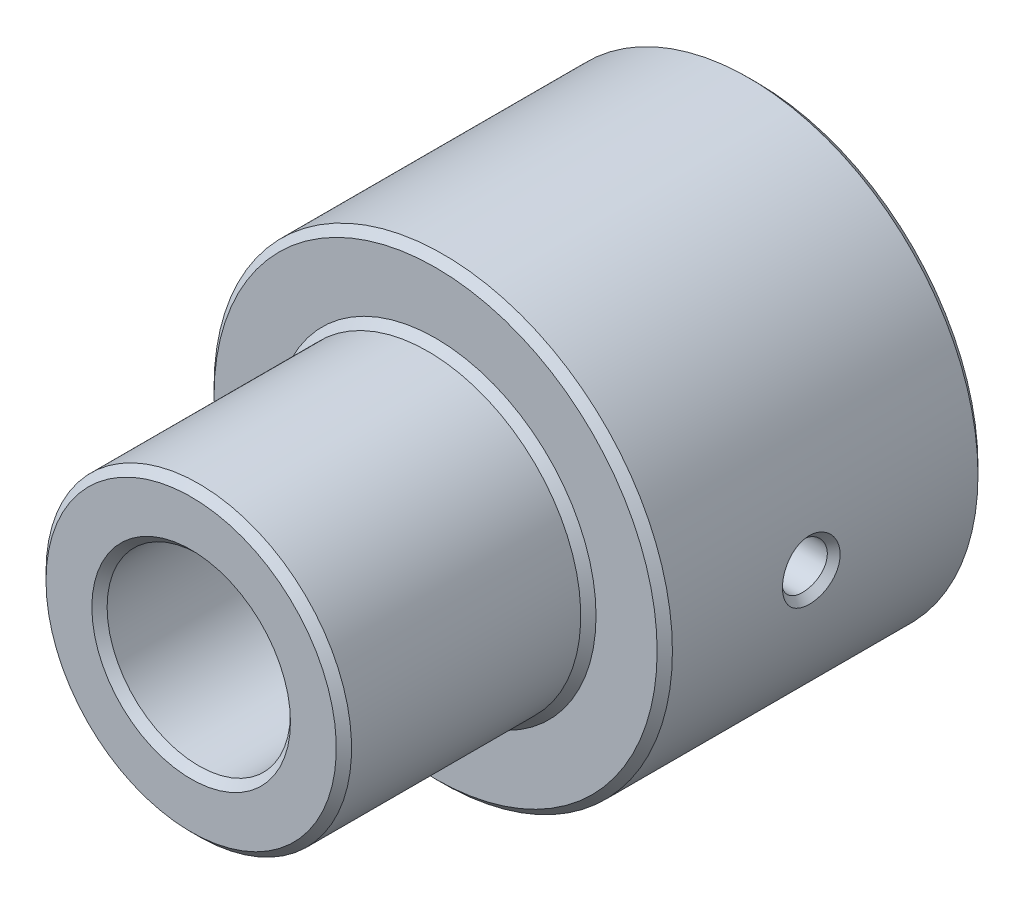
ISO-10303-21;
HEADER;
FILE_DESCRIPTION(('STEP AP214'),'2;1');
FILE_NAME('part.step','',(''),(''),'','','');
FILE_SCHEMA(('AUTOMOTIVE_DESIGN { 1 0 10303 214 1 1 1 1 }'));
ENDSEC;
DATA;
#1=APPLICATION_CONTEXT('core data for automotive mechanical design processes');
#2=APPLICATION_PROTOCOL_DEFINITION('international standard','automotive_design',2000,#1);
#3=PRODUCT_CONTEXT('',#1,'mechanical');
#4=PRODUCT('Part','Part','',(#3));
#5=PRODUCT_RELATED_PRODUCT_CATEGORY('part','',(#4));
#6=PRODUCT_DEFINITION_FORMATION('','',#4);
#7=PRODUCT_DEFINITION_CONTEXT('part definition',#1,'design');
#8=PRODUCT_DEFINITION('design','',#6,#7);
#9=PRODUCT_DEFINITION_SHAPE('','',#8);
#10=(LENGTH_UNIT() NAMED_UNIT(*) SI_UNIT(.MILLI.,.METRE.));
#11=(NAMED_UNIT(*) PLANE_ANGLE_UNIT() SI_UNIT($,.RADIAN.));
#12=(NAMED_UNIT(*) SI_UNIT($,.STERADIAN.) SOLID_ANGLE_UNIT());
#13=UNCERTAINTY_MEASURE_WITH_UNIT(LENGTH_MEASURE(1.E-05),#10,'distance_accuracy_value','');
#14=(GEOMETRIC_REPRESENTATION_CONTEXT(3) GLOBAL_UNCERTAINTY_ASSIGNED_CONTEXT((#13)) GLOBAL_UNIT_ASSIGNED_CONTEXT((#10,
#11,#12)) REPRESENTATION_CONTEXT('',''));
#15=CARTESIAN_POINT('',(0.,0.,0.));
#16=DIRECTION('',(0.,0.,1.));
#17=DIRECTION('',(1.,0.,0.));
#18=AXIS2_PLACEMENT_3D('',#15,#16,#17);
#19=CARTESIAN_POINT('',(0.,10.,0.));
#20=DIRECTION('',(0.,0.,-1.));
#21=DIRECTION('',(-1.,0.,0.));
#22=AXIS2_PLACEMENT_3D('',#19,#20,#21);
#23=PLANE('',#22);
#24=CARTESIAN_POINT('',(0.,0.,0.));
#25=DIRECTION('',(0.,0.,-1.));
#26=DIRECTION('',(-1.,0.,0.));
#27=AXIS2_PLACEMENT_3D('',#24,#25,#26);
#28=CIRCLE('',#27,9.49999999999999);
#29=CARTESIAN_POINT('',(-9.49999999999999,0.,0.));
#30=VERTEX_POINT('',#29);
#31=EDGE_CURVE('E10',#30,#30,#28,.F.);
#32=ORIENTED_EDGE('',*,*,#31,.T.);
#33=EDGE_LOOP('',(#32));
#34=FACE_BOUND('',#33,.T.);
#35=CARTESIAN_POINT('',(0.,0.,0.));
#36=DIRECTION('',(0.,0.,-1.));
#37=DIRECTION('',(-1.,0.,0.));
#38=AXIS2_PLACEMENT_3D('',#35,#36,#37);
#39=CIRCLE('',#38,6.49999999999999);
#40=CARTESIAN_POINT('',(-6.49999999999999,0.,0.));
#41=VERTEX_POINT('',#40);
#42=EDGE_CURVE('E39',#41,#41,#39,.T.);
#43=ORIENTED_EDGE('',*,*,#42,.T.);
#44=EDGE_LOOP('',(#43));
#45=FACE_BOUND('',#44,.T.);
#46=ADVANCED_FACE('F29',(#34,#45),#23,.F.);
#47=CARTESIAN_POINT('',(0.,0.,0.));
#48=DIRECTION('',(0.,0.,1.));
#49=DIRECTION('',(1.,0.,0.));
#50=AXIS2_PLACEMENT_3D('',#47,#48,#49);
#51=CYLINDRICAL_SURFACE('',#50,6.);
#52=CARTESIAN_POINT('',(0.,0.,-36.5));
#53=DIRECTION('',(0.,0.,1.));
#54=DIRECTION('',(1.,0.,0.));
#55=AXIS2_PLACEMENT_3D('',#52,#53,#54);
#56=CIRCLE('',#55,6.);
#57=CARTESIAN_POINT('',(6.,0.,-36.5));
#58=VERTEX_POINT('',#57);
#59=EDGE_CURVE('E290',#58,#58,#56,.F.);
#60=ORIENTED_EDGE('',*,*,#59,.T.);
#61=EDGE_LOOP('',(#60));
#62=FACE_BOUND('',#61,.T.);
#63=CARTESIAN_POINT('',(-6.,0.,-27.59));
#64=CARTESIAN_POINT('',(-6.00000223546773,0.030459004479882,-27.5900079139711));
#65=CARTESIAN_POINT('',(-5.99974384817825,0.0609162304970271,-27.5891627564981));
#66=CARTESIAN_POINT('',(-5.99873322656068,0.121687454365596,-27.5857994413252));
#67=CARTESIAN_POINT('',(-5.99798168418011,0.152001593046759,-27.5832836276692));
#68=CARTESIAN_POINT('',(-5.99601231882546,0.212423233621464,-27.5766130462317));
#69=CARTESIAN_POINT('',(-5.9947946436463,0.242530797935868,-27.5724587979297));
#70=CARTESIAN_POINT('',(-5.9919210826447,0.302477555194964,-27.5625470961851));
#71=CARTESIAN_POINT('',(-5.99026493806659,0.332316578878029,-27.5567886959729));
#72=CARTESIAN_POINT('',(-5.9865421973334,0.39166425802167,-27.5437035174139));
#73=CARTESIAN_POINT('',(-5.98447505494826,0.421172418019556,-27.5363746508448));
#74=CARTESIAN_POINT('',(-5.97995800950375,0.479796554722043,-27.520183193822));
#75=CARTESIAN_POINT('',(-5.97750737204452,0.508911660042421,-27.511317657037));
#76=CARTESIAN_POINT('',(-5.97225091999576,0.566687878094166,-27.4920871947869));
#77=CARTESIAN_POINT('',(-5.96944426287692,0.595347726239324,-27.4817187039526));
#78=CARTESIAN_POINT('',(-5.96350328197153,0.652151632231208,-27.4595164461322));
#79=CARTESIAN_POINT('',(-5.96036806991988,0.680294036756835,-27.4476786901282));
#80=CARTESIAN_POINT('',(-5.95379743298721,0.736001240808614,-27.4225718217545));
#81=CARTESIAN_POINT('',(-5.95036112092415,0.76356401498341,-27.4092984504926));
#82=CARTESIAN_POINT('',(-5.94321568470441,0.818050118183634,-27.3813541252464));
#83=CARTESIAN_POINT('',(-5.93950570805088,0.844971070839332,-27.3666787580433));
#84=CARTESIAN_POINT('',(-5.9318403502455,0.898111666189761,-27.3359640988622));
#85=CARTESIAN_POINT('',(-5.9278841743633,0.924328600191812,-27.3199203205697));
#86=CARTESIAN_POINT('',(-5.91975366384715,0.975999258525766,-27.286502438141));
#87=CARTESIAN_POINT('',(-5.91557860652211,1.00144995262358,-27.269123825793));
#88=CARTESIAN_POINT('',(-5.90703809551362,1.05152625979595,-27.2330697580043));
#89=CARTESIAN_POINT('',(-5.90267200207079,1.0761485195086,-27.2143897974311));
#90=CARTESIAN_POINT('',(-5.89377518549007,1.12450592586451,-27.1757667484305));
#91=CARTESIAN_POINT('',(-5.88924390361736,1.14823737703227,-27.1558191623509));
#92=CARTESIAN_POINT('',(-5.88004993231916,1.19475175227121,-27.1146936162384));
#93=CARTESIAN_POINT('',(-5.87538679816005,1.21753060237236,-27.0935111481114));
#94=CARTESIAN_POINT('',(-5.86593433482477,1.26207614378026,-27.0499522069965));
#95=CARTESIAN_POINT('',(-5.8611445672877,1.28383831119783,-27.0275712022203));
#96=CARTESIAN_POINT('',(-5.85155050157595,1.32628962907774,-26.9816442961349));
#97=CARTESIAN_POINT('',(-5.84674622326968,1.34697406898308,-26.9580940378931));
#98=CARTESIAN_POINT('',(-5.83723796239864,1.38724026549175,-26.909890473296));
#99=CARTESIAN_POINT('',(-5.83253444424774,1.40681740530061,-26.885233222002));
#100=CARTESIAN_POINT('',(-5.82323644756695,1.44483611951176,-26.8348861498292));
#101=CARTESIAN_POINT('',(-5.81864245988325,1.46327302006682,-26.8091927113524));
#102=CARTESIAN_POINT('',(-5.80960058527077,1.4989804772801,-26.7568400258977));
#103=CARTESIAN_POINT('',(-5.80515330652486,1.51624643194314,-26.7301775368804));
#104=CARTESIAN_POINT('',(-5.796434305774,1.54958049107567,-26.6759544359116));
#105=CARTESIAN_POINT('',(-5.79216325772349,1.56564415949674,-26.6483909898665));
#106=CARTESIAN_POINT('',(-5.78382825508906,1.59654220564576,-26.5924333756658));
#107=CARTESIAN_POINT('',(-5.77976502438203,1.61137238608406,-26.5640367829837));
#108=CARTESIAN_POINT('',(-5.77187666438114,1.63977189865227,-26.5064803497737));
#109=CARTESIAN_POINT('',(-5.76805228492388,1.65333732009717,-26.4773184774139));
#110=CARTESIAN_POINT('',(-5.76067280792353,1.67917572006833,-26.4182989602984));
#111=CARTESIAN_POINT('',(-5.75711846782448,1.69144509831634,-26.3884396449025));
#112=CARTESIAN_POINT('',(-5.75031022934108,1.71465978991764,-26.3280927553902));
#113=CARTESIAN_POINT('',(-5.74705708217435,1.72560181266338,-26.2976038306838));
#114=CARTESIAN_POINT('',(-5.7408824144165,1.74613017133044,-26.2360652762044));
#115=CARTESIAN_POINT('',(-5.73796163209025,1.75571350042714,-26.2050145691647));
#116=CARTESIAN_POINT('',(-5.73248288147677,1.77349287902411,-26.1424200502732));
#117=CARTESIAN_POINT('',(-5.72992564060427,1.78168615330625,-26.1108753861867));
#118=CARTESIAN_POINT('',(-5.72520516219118,1.79665386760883,-26.0473605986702));
#119=CARTESIAN_POINT('',(-5.72304265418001,1.80342568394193,-26.015389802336));
#120=CARTESIAN_POINT('',(-5.71914280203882,1.81551906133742,-25.951090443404));
#121=CARTESIAN_POINT('',(-5.71740621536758,1.82083804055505,-25.9187613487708));
#122=CARTESIAN_POINT('',(-5.71438939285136,1.82999423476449,-25.8538131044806));
#123=CARTESIAN_POINT('',(-5.71310998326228,1.83382876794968,-25.8211935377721));
#124=CARTESIAN_POINT('',(-5.71103845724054,1.83998544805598,-25.7557321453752));
#125=CARTESIAN_POINT('',(-5.71024729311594,1.84230463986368,-25.7228900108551));
#126=CARTESIAN_POINT('',(-5.70918389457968,1.84539740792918,-25.6570510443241));
#127=CARTESIAN_POINT('',(-5.70891281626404,1.84616754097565,-25.6240540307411));
#128=CARTESIAN_POINT('',(-5.70891831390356,1.84613963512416,-25.5580606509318));
#129=CARTESIAN_POINT('',(-5.70919489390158,1.84534158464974,-25.5250642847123));
#130=CARTESIAN_POINT('',(-5.71026523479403,1.84220827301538,-25.4592268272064));
#131=CARTESIAN_POINT('',(-5.711057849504,1.83987641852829,-25.4263855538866));
#132=CARTESIAN_POINT('',(-5.71312981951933,1.8337040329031,-25.3609254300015));
#133=CARTESIAN_POINT('',(-5.71440822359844,1.82986644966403,-25.3283062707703));
#134=CARTESIAN_POINT('',(-5.71742067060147,1.82071368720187,-25.2633576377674));
#135=CARTESIAN_POINT('',(-5.71915388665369,1.815401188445,-25.2310277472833));
#136=CARTESIAN_POINT('',(-5.72304512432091,1.80332873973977,-25.1667248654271));
#137=CARTESIAN_POINT('',(-5.72520238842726,1.79657136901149,-25.1347513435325));
#138=CARTESIAN_POINT('',(-5.7299108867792,1.78163935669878,-25.0712284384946));
#139=CARTESIAN_POINT('',(-5.73246139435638,1.77346732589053,-25.0396783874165));
#140=CARTESIAN_POINT('',(-5.73792559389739,1.7557359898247,-24.977069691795));
#141=CARTESIAN_POINT('',(-5.74083856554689,1.74617942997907,-24.9460102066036));
#142=CARTESIAN_POINT('',(-5.74699692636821,1.72570894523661,-24.8844499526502));
#143=CARTESIAN_POINT('',(-5.75024158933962,1.71479797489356,-24.8539481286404));
#144=CARTESIAN_POINT('',(-5.75703257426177,1.69164850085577,-24.7935705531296));
#145=CARTESIAN_POINT('',(-5.76057816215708,1.67941320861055,-24.763693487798));
#146=CARTESIAN_POINT('',(-5.76794024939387,1.65364487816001,-24.7046328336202));
#147=CARTESIAN_POINT('',(-5.7717560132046,1.64011533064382,-24.6754476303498));
#148=CARTESIAN_POINT('',(-5.77962765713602,1.61178824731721,-24.6178381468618));
#149=CARTESIAN_POINT('',(-5.78368281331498,1.59699447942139,-24.589411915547));
#150=CARTESIAN_POINT('',(-5.79200258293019,1.56616874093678,-24.533387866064));
#151=CARTESIAN_POINT('',(-5.7962665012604,1.55014078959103,-24.5057877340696));
#152=CARTESIAN_POINT('',(-5.80497256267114,1.51687639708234,-24.451483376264));
#153=CARTESIAN_POINT('',(-5.80941406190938,1.49964417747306,-24.4247764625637));
#154=CARTESIAN_POINT('',(-5.81844609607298,1.46400137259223,-24.3723261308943));
#155=CARTESIAN_POINT('',(-5.82303605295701,1.44559513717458,-24.3465796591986));
#156=CARTESIAN_POINT('',(-5.83232813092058,1.40763314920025,-24.2961174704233));
#157=CARTESIAN_POINT('',(-5.83702978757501,1.38808178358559,-24.2713983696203));
#158=CARTESIAN_POINT('',(-5.84653681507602,1.34786348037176,-24.2230593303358));
#159=CARTESIAN_POINT('',(-5.8513417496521,1.32720083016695,-24.1994357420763));
#160=CARTESIAN_POINT('',(-5.86093894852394,1.284785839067,-24.1533629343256));
#161=CARTESIAN_POINT('',(-5.86573118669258,1.26303818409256,-24.1309093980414));
#162=CARTESIAN_POINT('',(-5.87518917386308,1.21851264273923,-24.0872191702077));
#163=CARTESIAN_POINT('',(-5.87985537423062,1.19573953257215,-24.0659777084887));
#164=CARTESIAN_POINT('',(-5.88905595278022,1.14923074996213,-24.024744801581));
#165=CARTESIAN_POINT('',(-5.89359078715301,1.12549933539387,-24.0047486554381));
#166=CARTESIAN_POINT('',(-5.90249512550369,1.07713659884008,-23.9660384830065));
#167=CARTESIAN_POINT('',(-5.90686520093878,1.05250911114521,-23.9473197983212));
#168=CARTESIAN_POINT('',(-5.91541402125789,1.00241811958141,-23.9111969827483));
#169=CARTESIAN_POINT('',(-5.919593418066,0.976958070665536,-23.893788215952));
#170=CARTESIAN_POINT('',(-5.92773288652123,0.925265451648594,-23.8603176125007));
#171=CARTESIAN_POINT('',(-5.9316936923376,0.899035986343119,-23.8442511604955));
#172=CARTESIAN_POINT('',(-5.93936852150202,0.845868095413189,-23.8134975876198));
#173=CARTESIAN_POINT('',(-5.94308335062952,0.818932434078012,-23.7988058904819));
#174=CARTESIAN_POINT('',(-5.95023863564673,0.764415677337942,-23.7708342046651));
#175=CARTESIAN_POINT('',(-5.95367995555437,0.736837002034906,-23.7575497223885));
#176=CARTESIAN_POINT('',(-5.96026068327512,0.681097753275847,-23.732424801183));
#177=CARTESIAN_POINT('',(-5.96340099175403,0.652939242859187,-23.7205800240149));
#178=CARTESIAN_POINT('',(-5.96935216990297,0.596103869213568,-23.6983667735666));
#179=CARTESIAN_POINT('',(-5.97216394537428,0.567428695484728,-23.6879942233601));
#180=CARTESIAN_POINT('',(-5.97743056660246,0.509623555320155,-23.6687575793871));
#181=CARTESIAN_POINT('',(-5.97988627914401,0.480494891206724,-23.6598898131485));
#182=CARTESIAN_POINT('',(-5.98441332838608,0.42184633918,-23.6436947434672));
#183=CARTESIAN_POINT('',(-5.98648543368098,0.392327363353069,-23.6363643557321));
#184=CARTESIAN_POINT('',(-5.99021788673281,0.332961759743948,-23.623275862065));
#185=CARTESIAN_POINT('',(-5.99187882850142,0.303115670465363,-23.6175154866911));
#186=CARTESIAN_POINT('',(-5.99476164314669,0.243159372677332,-23.607598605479));
#187=CARTESIAN_POINT('',(-5.99598384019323,0.213049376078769,-23.6034409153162));
#188=CARTESIAN_POINT('',(-5.99796198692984,0.152628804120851,-23.5967607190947));
#189=CARTESIAN_POINT('',(-5.99871787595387,0.122318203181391,-23.5942384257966));
#190=CARTESIAN_POINT('',(-5.99973621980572,0.061559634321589,-23.5908600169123));
#191=CARTESIAN_POINT('',(-5.99999809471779,0.0311115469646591,-23.5900058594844));
#192=CARTESIAN_POINT('',(-6.0000018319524,-0.0297848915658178,-23.5899943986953));
#193=CARTESIAN_POINT('',(-5.99974369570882,-0.0602332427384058,-23.5908370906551));
#194=CARTESIAN_POINT('',(-5.99873345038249,-0.120992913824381,-23.594192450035));
#195=CARTESIAN_POINT('',(-5.99798192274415,-0.151304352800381,-23.5967031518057));
#196=CARTESIAN_POINT('',(-5.99601284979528,-0.211727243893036,-23.6033597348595));
#197=CARTESIAN_POINT('',(-5.99479536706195,-0.241838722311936,-23.6075053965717));
#198=CARTESIAN_POINT('',(-5.99192230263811,-0.301798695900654,-23.6173975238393));
#199=CARTESIAN_POINT('',(-5.99026639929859,-0.331646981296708,-23.623145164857));
#200=CARTESIAN_POINT('',(-5.98654425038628,-0.39101775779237,-23.6362072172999));
#201=CARTESIAN_POINT('',(-5.98447741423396,-0.42053971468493,-23.6435238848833));
#202=CARTESIAN_POINT('',(-5.97996105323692,-0.47919507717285,-23.6596902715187));
#203=CARTESIAN_POINT('',(-5.97751076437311,-0.508327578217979,-23.6685430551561));
#204=CARTESIAN_POINT('',(-5.97225505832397,-0.56614130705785,-23.6877482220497));
#205=CARTESIAN_POINT('',(-5.96944878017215,-0.594821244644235,-23.6981042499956));
#206=CARTESIAN_POINT('',(-5.96350858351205,-0.651667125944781,-23.7202826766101));
#207=CARTESIAN_POINT('',(-5.96037376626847,-0.679831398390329,-23.7321091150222));
#208=CARTESIAN_POINT('',(-5.95380392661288,-0.735583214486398,-23.7571953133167));
#209=CARTESIAN_POINT('',(-5.95036801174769,-0.763168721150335,-23.7704593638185));
#210=CARTESIAN_POINT('',(-5.94322336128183,-0.817700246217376,-23.7983878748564));
#211=CARTESIAN_POINT('',(-5.93951377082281,-0.844643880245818,-23.8130567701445));
#212=CARTESIAN_POINT('',(-5.93184916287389,-0.897828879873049,-23.8437621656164));
#213=CARTESIAN_POINT('',(-5.92789334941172,-0.924067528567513,-23.8598031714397));
#214=CARTESIAN_POINT('',(-5.9197635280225,-0.975779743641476,-23.8932200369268));
#215=CARTESIAN_POINT('',(-5.91558879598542,-1.00125026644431,-23.910600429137));
#216=CARTESIAN_POINT('',(-5.9070488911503,-1.05136346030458,-23.9466634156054));
#217=CARTESIAN_POINT('',(-5.90268307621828,-1.07600275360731,-23.9653505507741));
#218=CARTESIAN_POINT('',(-5.89378675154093,-1.12439052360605,-24.0039941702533));
#219=CARTESIAN_POINT('',(-5.88925567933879,-1.14813526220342,-24.0239552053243));
#220=CARTESIAN_POINT('',(-5.88006208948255,-1.19467173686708,-24.0651145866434));
#221=CARTESIAN_POINT('',(-5.87539912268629,-1.21745933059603,-24.0863175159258));
#222=CARTESIAN_POINT('',(-5.86594680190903,-1.26201654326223,-24.1299255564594));
#223=CARTESIAN_POINT('',(-5.86115700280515,-1.28378153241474,-24.1523353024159));
#224=CARTESIAN_POINT('',(-5.85156317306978,-1.32623370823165,-24.198327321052));
#225=CARTESIAN_POINT('',(-5.84675916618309,-1.34691603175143,-24.2219140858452));
#226=CARTESIAN_POINT('',(-5.83725205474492,-1.38717599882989,-24.2701958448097));
#227=CARTESIAN_POINT('',(-5.83254943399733,-1.40674886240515,-24.294894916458));
#228=CARTESIAN_POINT('',(-5.8232535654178,-1.44475717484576,-24.3453299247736));
#229=CARTESIAN_POINT('',(-5.81866082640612,-1.46318779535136,-24.3710695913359));
#230=CARTESIAN_POINT('',(-5.80962169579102,-1.49888157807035,-24.4235176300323));
#231=CARTESIAN_POINT('',(-5.80517593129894,-1.51614000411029,-24.4502293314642));
#232=CARTESIAN_POINT('',(-5.79646006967,-1.54945845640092,-24.5045524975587));
#233=CARTESIAN_POINT('',(-5.79219066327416,-1.5655139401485,-24.5321668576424));
#234=CARTESIAN_POINT('',(-5.7838589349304,-1.59639566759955,-24.5882266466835));
#235=CARTESIAN_POINT('',(-5.77979734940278,-1.61121764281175,-24.616674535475));
#236=CARTESIAN_POINT('',(-5.77191214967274,-1.63960137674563,-24.6743326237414));
#237=CARTESIAN_POINT('',(-5.76808929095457,-1.65315919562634,-24.7035448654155));
#238=CARTESIAN_POINT('',(-5.76071260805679,-1.67898359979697,-24.762662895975));
#239=CARTESIAN_POINT('',(-5.75715953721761,-1.69124660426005,-24.7925703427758));
#240=CARTESIAN_POINT('',(-5.75035347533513,-1.71445032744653,-24.8530099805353));
#241=CARTESIAN_POINT('',(-5.7471012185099,-1.72538783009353,-24.8835434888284));
#242=CARTESIAN_POINT('',(-5.74092785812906,-1.74590949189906,-24.9451664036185));
#243=CARTESIAN_POINT('',(-5.73800745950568,-1.75549078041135,-24.9762568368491));
#244=CARTESIAN_POINT('',(-5.73252889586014,-1.77326897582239,-25.0389247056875));
#245=CARTESIAN_POINT('',(-5.72997140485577,-1.78146331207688,-25.0705029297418));
#246=CARTESIAN_POINT('',(-5.72524973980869,-1.79643660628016,-25.1340774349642));
#247=CARTESIAN_POINT('',(-5.72308621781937,-1.80321322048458,-25.1660743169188));
#248=CARTESIAN_POINT('',(-5.71918355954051,-1.81532016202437,-25.2304171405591));
#249=CARTESIAN_POINT('',(-5.71744507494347,-1.82064826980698,-25.2627635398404));
#250=CARTESIAN_POINT('',(-5.71442355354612,-1.82982733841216,-25.3277363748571));
#251=CARTESIAN_POINT('',(-5.7131412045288,-1.83367606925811,-25.3603631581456));
#252=CARTESIAN_POINT('',(-5.71106291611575,-1.83986586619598,-25.4258276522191));
#253=CARTESIAN_POINT('',(-5.71026775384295,-1.84220452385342,-25.4586656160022));
#254=CARTESIAN_POINT('',(-5.70919497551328,-1.84534305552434,-25.5244835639));
#255=CARTESIAN_POINT('',(-5.70891829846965,-1.84614013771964,-25.5574636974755));
#256=CARTESIAN_POINT('',(-5.70891269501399,-1.84616745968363,-25.6234153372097));
#257=CARTESIAN_POINT('',(-5.70918361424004,-1.84539814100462,-25.6563868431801));
#258=CARTESIAN_POINT('',(-5.71024400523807,-1.84231813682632,-25.7221718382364));
#259=CARTESIAN_POINT('',(-5.7110322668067,-1.84001104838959,-25.754985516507));
#260=CARTESIAN_POINT('',(-5.71309636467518,-1.83388569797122,-25.820387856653));
#261=CARTESIAN_POINT('',(-5.71437119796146,-1.83007054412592,-25.8529768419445));
#262=CARTESIAN_POINT('',(-5.71737732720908,-1.8209597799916,-25.9178626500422));
#263=CARTESIAN_POINT('',(-5.71910775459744,-1.81566698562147,-25.9501599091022));
#264=CARTESIAN_POINT('',(-5.72299408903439,-1.8036312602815,-26.0143951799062));
#265=CARTESIAN_POINT('',(-5.72514920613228,-1.79689101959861,-26.0463337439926));
#266=CARTESIAN_POINT('',(-5.72985397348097,-1.78199061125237,-26.1097845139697));
#267=CARTESIAN_POINT('',(-5.7324028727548,-1.7738331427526,-26.1412974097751));
#268=CARTESIAN_POINT('',(-5.7378642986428,-1.75612834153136,-26.2038297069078));
#269=CARTESIAN_POINT('',(-5.74077608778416,-1.74658382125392,-26.2348499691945));
#270=CARTESIAN_POINT('',(-5.74693241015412,-1.72613488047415,-26.2963298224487));
#271=CARTESIAN_POINT('',(-5.75017620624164,-1.71523346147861,-26.3267904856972));
#272=CARTESIAN_POINT('',(-5.75696566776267,-1.69210061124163,-26.3870839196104));
#273=CARTESIAN_POINT('',(-5.76051059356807,-1.67987241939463,-26.4169180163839));
#274=CARTESIAN_POINT('',(-5.76787145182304,-1.65411586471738,-26.4758910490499));
#275=CARTESIAN_POINT('',(-5.771686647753,-1.64059100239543,-26.5050316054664));
#276=CARTESIAN_POINT('',(-5.77955713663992,-1.61227092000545,-26.5625502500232));
#277=CARTESIAN_POINT('',(-5.78361170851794,-1.59747946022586,-26.5909302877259));
#278=CARTESIAN_POINT('',(-5.79193017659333,-1.56665601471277,-26.6468605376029));
#279=CARTESIAN_POINT('',(-5.79619338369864,-1.55062802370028,-26.6744130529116));
#280=CARTESIAN_POINT('',(-5.80489777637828,-1.51736130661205,-26.7286209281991));
#281=CARTESIAN_POINT('',(-5.80933832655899,-1.50012676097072,-26.7552789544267));
#282=CARTESIAN_POINT('',(-5.81836810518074,-1.4644770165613,-26.8076303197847));
#283=CARTESIAN_POINT('',(-5.82295676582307,-1.44606611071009,-26.8333266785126));
#284=CARTESIAN_POINT('',(-5.83224577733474,-1.40809289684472,-26.8836879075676));
#285=CARTESIAN_POINT('',(-5.83694567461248,-1.38853490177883,-26.9083561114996));
#286=CARTESIAN_POINT('',(-5.84644861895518,-1.34830020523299,-26.9565916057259));
#287=CARTESIAN_POINT('',(-5.85125124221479,-1.32762770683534,-26.9801624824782));
#288=CARTESIAN_POINT('',(-5.8608440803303,-1.28519025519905,-27.0261374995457));
#289=CARTESIAN_POINT('',(-5.86563427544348,-1.26342962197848,-27.0485456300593));
#290=CARTESIAN_POINT('',(-5.87508944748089,-1.21887598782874,-27.0921614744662));
#291=CARTESIAN_POINT('',(-5.87975482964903,-1.19608720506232,-27.1133734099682));
#292=CARTESIAN_POINT('',(-5.8889549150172,-1.14954407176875,-27.1545607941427));
#293=CARTESIAN_POINT('',(-5.8934900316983,-1.12579353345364,-27.174540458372));
#294=CARTESIAN_POINT('',(-5.90239592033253,-1.07739027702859,-27.2132298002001));
#295=CARTESIAN_POINT('',(-5.90676721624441,-1.05274104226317,-27.2319437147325));
#296=CARTESIAN_POINT('',(-5.91531931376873,-1.00260460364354,-27.2680673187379));
#297=CARTESIAN_POINT('',(-5.91950072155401,-0.977120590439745,-27.2854812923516));
#298=CARTESIAN_POINT('',(-5.92764489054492,-0.925378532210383,-27.3189709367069));
#299=CARTESIAN_POINT('',(-5.93160834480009,-0.899123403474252,-27.3350509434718));
#300=CARTESIAN_POINT('',(-5.93928898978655,-0.84590309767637,-27.3658385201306));
#301=CARTESIAN_POINT('',(-5.94300695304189,-0.81894056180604,-27.3805504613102));
#302=CARTESIAN_POINT('',(-5.95016886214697,-0.764369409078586,-27.4085678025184));
#303=CARTESIAN_POINT('',(-5.95361364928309,-0.736763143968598,-27.4218775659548));
#304=CARTESIAN_POINT('',(-5.96020150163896,-0.680968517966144,-27.4470564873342));
#305=CARTESIAN_POINT('',(-5.96334545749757,-0.652782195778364,-27.4589299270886));
#306=CARTESIAN_POINT('',(-5.96930395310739,-0.595891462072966,-27.4812022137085));
#307=CARTESIAN_POINT('',(-5.9721194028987,-0.567188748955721,-27.4916051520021));
#308=CARTESIAN_POINT('',(-5.97739322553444,-0.509329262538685,-27.5109025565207));
#309=CARTESIAN_POINT('',(-5.97985248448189,-0.48017382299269,-27.5198007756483));
#310=CARTESIAN_POINT('',(-5.98438631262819,-0.421472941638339,-27.536055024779));
#311=CARTESIAN_POINT('',(-5.98646168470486,-0.391928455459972,-27.5434142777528));
#312=CARTESIAN_POINT('',(-5.99020017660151,-0.332513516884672,-27.5565570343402));
#313=CARTESIAN_POINT('',(-5.99186393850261,-0.302643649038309,-27.5623429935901));
#314=CARTESIAN_POINT('',(-5.99475177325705,-0.242642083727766,-27.5723059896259));
#315=CARTESIAN_POINT('',(-5.99597622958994,-0.212510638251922,-27.5764844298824));
#316=CARTESIAN_POINT('',(-5.99795795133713,-0.152049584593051,-27.5831989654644));
#317=CARTESIAN_POINT('',(-5.99871522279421,-0.121719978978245,-27.5857350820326));
#318=CARTESIAN_POINT('',(-5.99973581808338,-0.0609277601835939,-27.5891338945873));
#319=CARTESIAN_POINT('',(-5.99999863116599,-0.0304650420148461,-27.5899948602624));
#320=CARTESIAN_POINT('',(-6.,0.,-27.59));
#321=B_SPLINE_CURVE_WITH_KNOTS('',3,(#63,#64,#65,#66,#67,#68,#69,#70,#71,#72,#73,#74,#75,#76,
#77,#78,#79,#80,#81,#82,#83,#84,#85,#86,#87,#88,#89,#90,#91,#92,#93,#94,#95,#96,#97,#98,#99,
#100,#101,#102,#103,#104,#105,#106,#107,#108,#109,#110,#111,#112,#113,#114,#115,#116,#117,#118,
#119,#120,#121,#122,#123,#124,#125,#126,#127,#128,#129,#130,#131,#132,#133,#134,#135,#136,#137,
#138,#139,#140,#141,#142,#143,#144,#145,#146,#147,#148,#149,#150,#151,#152,#153,#154,#155,#156,
#157,#158,#159,#160,#161,#162,#163,#164,#165,#166,#167,#168,#169,#170,#171,#172,#173,#174,#175,
#176,#177,#178,#179,#180,#181,#182,#183,#184,#185,#186,#187,#188,#189,#190,#191,#192,#193,#194,
#195,#196,#197,#198,#199,#200,#201,#202,#203,#204,#205,#206,#207,#208,#209,#210,#211,#212,#213,
#214,#215,#216,#217,#218,#219,#220,#221,#222,#223,#224,#225,#226,#227,#228,#229,#230,#231,#232,
#233,#234,#235,#236,#237,#238,#239,#240,#241,#242,#243,#244,#245,#246,#247,#248,#249,#250,#251,
#252,#253,#254,#255,#256,#257,#258,#259,#260,#261,#262,#263,#264,#265,#266,#267,#268,#269,#270,
#271,#272,#273,#274,#275,#276,#277,#278,#279,#280,#281,#282,#283,#284,#285,#286,#287,#288,#289,
#290,#291,#292,#293,#294,#295,#296,#297,#298,#299,#300,#301,#302,#303,#304,#305,#306,#307,#308,
#309,#310,#311,#312,#313,#314,#315,#316,#317,#318,#319,#320),.UNSPECIFIED.,.F.,.F.,(4,2,2,2,2,2,
2,2,2,2,2,2,2,2,2,2,2,2,2,2,2,2,2,2,2,2,2,2,2,2,2,2,2,2,2,2,2,2,2,2,2,2,2,2,2,2,2,2,2,2,2,2,2,2,
2,2,2,2,2,2,2,2,2,2,2,2,2,2,2,2,2,2,2,2,2,2,2,2,2,2,2,2,2,2,2,2,2,2,2,2,2,2,2,2,2,2,2,2,2,2,2,2,
2,2,2,2,2,2,2,2,2,2,2,2,2,2,2,2,2,2,2,2,2,2,2,2,2,2,4),(0.,0.0913610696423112,0.182594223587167,
0.27379847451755,0.365056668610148,0.456436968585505,0.547994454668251,0.639772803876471,
0.731806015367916,0.824120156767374,0.916735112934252,1.00966632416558,1.10292650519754,
1.19652733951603,1.29048114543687,1.38480251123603,1.47950989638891,1.57460144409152,
1.67006397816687,1.765894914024,1.86208293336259,1.9586099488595,2.05545302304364,
2.15258624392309,2.24998256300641,2.34761560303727,2.44546144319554,2.54350038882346,
2.64171873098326,2.74011049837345,2.83867920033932,2.9374395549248,3.03641919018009,
3.13539955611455,3.23416081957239,3.33272968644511,3.43112057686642,3.52933727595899,
3.62737461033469,3.72522013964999,3.82285585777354,3.92025990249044,4.01740827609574,
4.11427658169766,4.2108417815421,4.30708398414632,4.40298826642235,4.49854653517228,
4.59375942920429,4.68859173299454,4.78302061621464,4.87706821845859,4.97075218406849,
5.06408726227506,5.1570869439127,5.24976513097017,5.34213783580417,5.4342249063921,
5.52605177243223,5.61765120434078,5.70906507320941,5.80034609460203,5.89155953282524,
5.98278483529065,6.07411715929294,6.1654492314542,6.2566738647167,6.34788625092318,
6.43916574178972,6.53057737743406,6.62217352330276,6.71399557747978,6.80607571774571,
6.89843866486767,6.99110344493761,7.08408513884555,7.17739661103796,7.27105021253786,
7.36505945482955,7.45944065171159,7.55421452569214,7.64938287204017,7.74493416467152,
7.84086511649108,7.93716307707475,8.0338080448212,8.13077462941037,8.22803396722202,
8.32555559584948,8.42330929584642,8.52126690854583,8.61940413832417,8.71770234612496,
8.81615033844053,8.91474615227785,9.01349883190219,9.11243018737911,9.21133365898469,
9.31000658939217,9.40847720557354,9.50676143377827,9.60486454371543,9.70278282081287,
9.80050525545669,9.89801524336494,9.99529229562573,10.0923137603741,10.1890565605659,
10.2854989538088,10.3816223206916,10.4774129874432,10.5728640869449,10.6679774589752,
10.762739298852,10.8571425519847,10.9512025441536,11.0449302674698,11.1383340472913,
11.2314212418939,11.3241999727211,11.4166808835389,11.5088789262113,11.6008151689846,
11.692518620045,11.7840280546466,11.8753938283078,11.9666796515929,12.0579642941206,
12.1493431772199),.UNSPECIFIED.);
#322=CARTESIAN_POINT('',(-6.,0.,-27.59));
#323=VERTEX_POINT('',#322);
#324=EDGE_CURVE('E52',#323,#323,#321,.F.);
#325=ORIENTED_EDGE('',*,*,#324,.T.);
#326=EDGE_LOOP('',(#325));
#327=FACE_BOUND('',#326,.T.);
#328=CARTESIAN_POINT('',(6.,0.,-27.59));
#329=CARTESIAN_POINT('',(6.00000223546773,-0.0304590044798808,-27.5900079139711));
#330=CARTESIAN_POINT('',(5.99974384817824,-0.0609162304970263,-27.5891627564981));
#331=CARTESIAN_POINT('',(5.99873322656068,-0.121687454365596,-27.5857994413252));
#332=CARTESIAN_POINT('',(5.99798168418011,-0.152001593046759,-27.5832836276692));
#333=CARTESIAN_POINT('',(5.99601231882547,-0.212423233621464,-27.5766130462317));
#334=CARTESIAN_POINT('',(5.9947946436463,-0.242530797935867,-27.5724587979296));
#335=CARTESIAN_POINT('',(5.9919210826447,-0.302477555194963,-27.5625470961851));
#336=CARTESIAN_POINT('',(5.99026493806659,-0.332316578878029,-27.5567886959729));
#337=CARTESIAN_POINT('',(5.9865421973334,-0.39166425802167,-27.5437035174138));
#338=CARTESIAN_POINT('',(5.98447505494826,-0.421172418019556,-27.5363746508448));
#339=CARTESIAN_POINT('',(5.97995800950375,-0.479796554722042,-27.520183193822));
#340=CARTESIAN_POINT('',(5.97750737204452,-0.508911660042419,-27.511317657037));
#341=CARTESIAN_POINT('',(5.97225091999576,-0.566687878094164,-27.4920871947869));
#342=CARTESIAN_POINT('',(5.96944426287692,-0.595347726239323,-27.4817187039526));
#343=CARTESIAN_POINT('',(5.96350328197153,-0.652151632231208,-27.4595164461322));
#344=CARTESIAN_POINT('',(5.96036806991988,-0.680294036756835,-27.4476786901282));
#345=CARTESIAN_POINT('',(5.95379743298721,-0.736001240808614,-27.4225718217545));
#346=CARTESIAN_POINT('',(5.95036112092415,-0.763564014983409,-27.4092984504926));
#347=CARTESIAN_POINT('',(5.9432156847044,-0.818050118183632,-27.3813541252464));
#348=CARTESIAN_POINT('',(5.93950570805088,-0.844971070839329,-27.3666787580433));
#349=CARTESIAN_POINT('',(5.9318403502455,-0.898111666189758,-27.3359640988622));
#350=CARTESIAN_POINT('',(5.9278841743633,-0.92432860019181,-27.3199203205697));
#351=CARTESIAN_POINT('',(5.91975366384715,-0.975999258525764,-27.286502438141));
#352=CARTESIAN_POINT('',(5.91557860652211,-1.00144995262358,-27.269123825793));
#353=CARTESIAN_POINT('',(5.90703809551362,-1.05152625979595,-27.2330697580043));
#354=CARTESIAN_POINT('',(5.90267200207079,-1.07614851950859,-27.2143897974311));
#355=CARTESIAN_POINT('',(5.89377518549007,-1.1245059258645,-27.1757667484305));
#356=CARTESIAN_POINT('',(5.88924390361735,-1.14823737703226,-27.1558191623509));
#357=CARTESIAN_POINT('',(5.88004993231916,-1.1947517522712,-27.1146936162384));
#358=CARTESIAN_POINT('',(5.87538679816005,-1.21753060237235,-27.0935111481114));
#359=CARTESIAN_POINT('',(5.86593433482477,-1.26207614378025,-27.0499522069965));
#360=CARTESIAN_POINT('',(5.8611445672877,-1.28383831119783,-27.0275712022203));
#361=CARTESIAN_POINT('',(5.85155050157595,-1.32628962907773,-26.9816442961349));
#362=CARTESIAN_POINT('',(5.84674622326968,-1.34697406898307,-26.9580940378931));
#363=CARTESIAN_POINT('',(5.83723796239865,-1.38724026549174,-26.909890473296));
#364=CARTESIAN_POINT('',(5.83253444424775,-1.4068174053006,-26.885233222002));
#365=CARTESIAN_POINT('',(5.82323644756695,-1.44483611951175,-26.8348861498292));
#366=CARTESIAN_POINT('',(5.81864245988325,-1.46327302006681,-26.8091927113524));
#367=CARTESIAN_POINT('',(5.80960058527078,-1.49898047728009,-26.7568400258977));
#368=CARTESIAN_POINT('',(5.80515330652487,-1.51624643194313,-26.7301775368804));
#369=CARTESIAN_POINT('',(5.796434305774,-1.54958049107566,-26.6759544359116));
#370=CARTESIAN_POINT('',(5.7921632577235,-1.56564415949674,-26.6483909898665));
#371=CARTESIAN_POINT('',(5.78382825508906,-1.59654220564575,-26.5924333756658));
#372=CARTESIAN_POINT('',(5.77976502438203,-1.61137238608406,-26.5640367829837));
#373=CARTESIAN_POINT('',(5.77187666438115,-1.63977189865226,-26.5064803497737));
#374=CARTESIAN_POINT('',(5.76805228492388,-1.65333732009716,-26.4773184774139));
#375=CARTESIAN_POINT('',(5.76067280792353,-1.67917572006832,-26.4182989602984));
#376=CARTESIAN_POINT('',(5.75711846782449,-1.69144509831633,-26.3884396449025));
#377=CARTESIAN_POINT('',(5.75031022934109,-1.71465978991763,-26.3280927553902));
#378=CARTESIAN_POINT('',(5.74705708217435,-1.72560181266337,-26.2976038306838));
#379=CARTESIAN_POINT('',(5.7408824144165,-1.74613017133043,-26.2360652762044));
#380=CARTESIAN_POINT('',(5.73796163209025,-1.75571350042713,-26.2050145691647));
#381=CARTESIAN_POINT('',(5.73248288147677,-1.77349287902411,-26.1424200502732));
#382=CARTESIAN_POINT('',(5.72992564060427,-1.78168615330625,-26.1108753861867));
#383=CARTESIAN_POINT('',(5.72520516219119,-1.79665386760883,-26.0473605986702));
#384=CARTESIAN_POINT('',(5.72304265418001,-1.80342568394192,-26.015389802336));
#385=CARTESIAN_POINT('',(5.71914280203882,-1.81551906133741,-25.951090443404));
#386=CARTESIAN_POINT('',(5.71740621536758,-1.82083804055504,-25.9187613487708));
#387=CARTESIAN_POINT('',(5.71438939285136,-1.82999423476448,-25.8538131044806));
#388=CARTESIAN_POINT('',(5.71310998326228,-1.83382876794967,-25.8211935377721));
#389=CARTESIAN_POINT('',(5.71103845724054,-1.83998544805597,-25.7557321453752));
#390=CARTESIAN_POINT('',(5.71024729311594,-1.84230463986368,-25.7228900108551));
#391=CARTESIAN_POINT('',(5.70918389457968,-1.84539740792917,-25.6570510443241));
#392=CARTESIAN_POINT('',(5.70891281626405,-1.84616754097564,-25.6240540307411));
#393=CARTESIAN_POINT('',(5.70891831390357,-1.84613963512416,-25.5580606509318));
#394=CARTESIAN_POINT('',(5.70919489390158,-1.84534158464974,-25.5250642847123));
#395=CARTESIAN_POINT('',(5.71026523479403,-1.84220827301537,-25.4592268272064));
#396=CARTESIAN_POINT('',(5.711057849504,-1.83987641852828,-25.4263855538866));
#397=CARTESIAN_POINT('',(5.71312981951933,-1.8337040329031,-25.3609254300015));
#398=CARTESIAN_POINT('',(5.71440822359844,-1.82986644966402,-25.3283062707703));
#399=CARTESIAN_POINT('',(5.71742067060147,-1.82071368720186,-25.2633576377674));
#400=CARTESIAN_POINT('',(5.71915388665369,-1.81540118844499,-25.2310277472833));
#401=CARTESIAN_POINT('',(5.72304512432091,-1.80332873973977,-25.1667248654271));
#402=CARTESIAN_POINT('',(5.72520238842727,-1.79657136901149,-25.1347513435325));
#403=CARTESIAN_POINT('',(5.72991088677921,-1.78163935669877,-25.0712284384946));
#404=CARTESIAN_POINT('',(5.73246139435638,-1.77346732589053,-25.0396783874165));
#405=CARTESIAN_POINT('',(5.73792559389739,-1.75573598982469,-24.977069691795));
#406=CARTESIAN_POINT('',(5.74083856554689,-1.74617942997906,-24.9460102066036));
#407=CARTESIAN_POINT('',(5.74699692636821,-1.72570894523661,-24.8844499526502));
#408=CARTESIAN_POINT('',(5.75024158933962,-1.71479797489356,-24.8539481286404));
#409=CARTESIAN_POINT('',(5.75703257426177,-1.69164850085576,-24.7935705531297));
#410=CARTESIAN_POINT('',(5.76057816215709,-1.67941320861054,-24.763693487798));
#411=CARTESIAN_POINT('',(5.76794024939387,-1.65364487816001,-24.7046328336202));
#412=CARTESIAN_POINT('',(5.7717560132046,-1.64011533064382,-24.6754476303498));
#413=CARTESIAN_POINT('',(5.77962765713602,-1.61178824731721,-24.6178381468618));
#414=CARTESIAN_POINT('',(5.78368281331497,-1.59699447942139,-24.589411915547));
#415=CARTESIAN_POINT('',(5.79200258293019,-1.56616874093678,-24.533387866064));
#416=CARTESIAN_POINT('',(5.7962665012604,-1.55014078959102,-24.5057877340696));
#417=CARTESIAN_POINT('',(5.80497256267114,-1.51687639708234,-24.451483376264));
#418=CARTESIAN_POINT('',(5.80941406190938,-1.49964417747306,-24.4247764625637));
#419=CARTESIAN_POINT('',(5.81844609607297,-1.46400137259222,-24.3723261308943));
#420=CARTESIAN_POINT('',(5.82303605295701,-1.44559513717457,-24.3465796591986));
#421=CARTESIAN_POINT('',(5.83232813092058,-1.40763314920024,-24.2961174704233));
#422=CARTESIAN_POINT('',(5.83702978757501,-1.38808178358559,-24.2713983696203));
#423=CARTESIAN_POINT('',(5.84653681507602,-1.34786348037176,-24.2230593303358));
#424=CARTESIAN_POINT('',(5.8513417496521,-1.32720083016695,-24.1994357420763));
#425=CARTESIAN_POINT('',(5.86093894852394,-1.284785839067,-24.1533629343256));
#426=CARTESIAN_POINT('',(5.86573118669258,-1.26303818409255,-24.1309093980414));
#427=CARTESIAN_POINT('',(5.87518917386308,-1.21851264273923,-24.0872191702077));
#428=CARTESIAN_POINT('',(5.87985537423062,-1.19573953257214,-24.0659777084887));
#429=CARTESIAN_POINT('',(5.88905595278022,-1.14923074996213,-24.024744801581));
#430=CARTESIAN_POINT('',(5.89359078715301,-1.12549933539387,-24.0047486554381));
#431=CARTESIAN_POINT('',(5.90249512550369,-1.07713659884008,-23.9660384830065));
#432=CARTESIAN_POINT('',(5.90686520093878,-1.05250911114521,-23.9473197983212));
#433=CARTESIAN_POINT('',(5.91541402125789,-1.00241811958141,-23.9111969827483));
#434=CARTESIAN_POINT('',(5.91959341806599,-0.976958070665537,-23.893788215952));
#435=CARTESIAN_POINT('',(5.92773288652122,-0.925265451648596,-23.8603176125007));
#436=CARTESIAN_POINT('',(5.9316936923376,-0.899035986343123,-23.8442511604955));
#437=CARTESIAN_POINT('',(5.93936852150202,-0.845868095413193,-23.8134975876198));
#438=CARTESIAN_POINT('',(5.94308335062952,-0.818932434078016,-23.7988058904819));
#439=CARTESIAN_POINT('',(5.95023863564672,-0.764415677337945,-23.7708342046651));
#440=CARTESIAN_POINT('',(5.95367995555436,-0.73683700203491,-23.7575497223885));
#441=CARTESIAN_POINT('',(5.96026068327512,-0.681097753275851,-23.7324248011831));
#442=CARTESIAN_POINT('',(5.96340099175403,-0.652939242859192,-23.720580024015));
#443=CARTESIAN_POINT('',(5.96935216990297,-0.596103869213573,-23.6983667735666));
#444=CARTESIAN_POINT('',(5.97216394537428,-0.567428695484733,-23.6879942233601));
#445=CARTESIAN_POINT('',(5.97743056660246,-0.509623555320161,-23.6687575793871));
#446=CARTESIAN_POINT('',(5.97988627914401,-0.480494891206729,-23.6598898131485));
#447=CARTESIAN_POINT('',(5.98441332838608,-0.421846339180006,-23.6436947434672));
#448=CARTESIAN_POINT('',(5.98648543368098,-0.392327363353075,-23.6363643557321));
#449=CARTESIAN_POINT('',(5.99021788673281,-0.332961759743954,-23.623275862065));
#450=CARTESIAN_POINT('',(5.99187882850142,-0.303115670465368,-23.6175154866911));
#451=CARTESIAN_POINT('',(5.99476164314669,-0.243159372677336,-23.607598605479));
#452=CARTESIAN_POINT('',(5.99598384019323,-0.213049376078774,-23.6034409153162));
#453=CARTESIAN_POINT('',(5.99796198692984,-0.152628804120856,-23.5967607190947));
#454=CARTESIAN_POINT('',(5.99871787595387,-0.122318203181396,-23.5942384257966));
#455=CARTESIAN_POINT('',(5.99973621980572,-0.0615596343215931,-23.5908600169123));
#456=CARTESIAN_POINT('',(5.99999809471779,-0.0311115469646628,-23.5900058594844));
#457=CARTESIAN_POINT('',(6.0000018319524,0.0297848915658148,-23.5899943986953));
#458=CARTESIAN_POINT('',(5.99974369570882,0.0602332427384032,-23.5908370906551));
#459=CARTESIAN_POINT('',(5.99873345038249,0.120992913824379,-23.594192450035));
#460=CARTESIAN_POINT('',(5.99798192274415,0.151304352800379,-23.5967031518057));
#461=CARTESIAN_POINT('',(5.99601284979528,0.211727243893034,-23.6033597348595));
#462=CARTESIAN_POINT('',(5.99479536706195,0.241838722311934,-23.6075053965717));
#463=CARTESIAN_POINT('',(5.99192230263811,0.301798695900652,-23.6173975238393));
#464=CARTESIAN_POINT('',(5.99026639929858,0.331646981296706,-23.623145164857));
#465=CARTESIAN_POINT('',(5.98654425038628,0.391017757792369,-23.6362072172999));
#466=CARTESIAN_POINT('',(5.98447741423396,0.420539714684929,-23.6435238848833));
#467=CARTESIAN_POINT('',(5.97996105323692,0.479195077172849,-23.6596902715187));
#468=CARTESIAN_POINT('',(5.97751076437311,0.508327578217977,-23.6685430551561));
#469=CARTESIAN_POINT('',(5.97225505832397,0.566141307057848,-23.6877482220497));
#470=CARTESIAN_POINT('',(5.96944878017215,0.594821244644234,-23.6981042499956));
#471=CARTESIAN_POINT('',(5.96350858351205,0.651667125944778,-23.7202826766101));
#472=CARTESIAN_POINT('',(5.96037376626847,0.679831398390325,-23.7321091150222));
#473=CARTESIAN_POINT('',(5.95380392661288,0.735583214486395,-23.7571953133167));
#474=CARTESIAN_POINT('',(5.95036801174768,0.763168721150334,-23.7704593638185));
#475=CARTESIAN_POINT('',(5.94322336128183,0.817700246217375,-23.7983878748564));
#476=CARTESIAN_POINT('',(5.9395137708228,0.844643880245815,-23.8130567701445));
#477=CARTESIAN_POINT('',(5.93184916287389,0.897828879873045,-23.8437621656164));
#478=CARTESIAN_POINT('',(5.92789334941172,0.924067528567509,-23.8598031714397));
#479=CARTESIAN_POINT('',(5.9197635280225,0.975779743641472,-23.8932200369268));
#480=CARTESIAN_POINT('',(5.91558879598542,1.00125026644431,-23.910600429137));
#481=CARTESIAN_POINT('',(5.9070488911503,1.05136346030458,-23.9466634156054));
#482=CARTESIAN_POINT('',(5.90268307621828,1.07600275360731,-23.9653505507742));
#483=CARTESIAN_POINT('',(5.89378675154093,1.12439052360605,-24.0039941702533));
#484=CARTESIAN_POINT('',(5.88925567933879,1.14813526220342,-24.0239552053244));
#485=CARTESIAN_POINT('',(5.88006208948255,1.19467173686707,-24.0651145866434));
#486=CARTESIAN_POINT('',(5.87539912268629,1.21745933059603,-24.0863175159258));
#487=CARTESIAN_POINT('',(5.86594680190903,1.26201654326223,-24.1299255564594));
#488=CARTESIAN_POINT('',(5.86115700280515,1.28378153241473,-24.1523353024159));
#489=CARTESIAN_POINT('',(5.85156317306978,1.32623370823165,-24.198327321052));
#490=CARTESIAN_POINT('',(5.84675916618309,1.34691603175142,-24.2219140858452));
#491=CARTESIAN_POINT('',(5.83725205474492,1.38717599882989,-24.2701958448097));
#492=CARTESIAN_POINT('',(5.83254943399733,1.40674886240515,-24.294894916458));
#493=CARTESIAN_POINT('',(5.8232535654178,1.44475717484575,-24.3453299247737));
#494=CARTESIAN_POINT('',(5.81866082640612,1.46318779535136,-24.3710695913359));
#495=CARTESIAN_POINT('',(5.80962169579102,1.49888157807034,-24.4235176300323));
#496=CARTESIAN_POINT('',(5.80517593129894,1.51614000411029,-24.4502293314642));
#497=CARTESIAN_POINT('',(5.79646006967,1.54945845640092,-24.5045524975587));
#498=CARTESIAN_POINT('',(5.79219066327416,1.56551394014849,-24.5321668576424));
#499=CARTESIAN_POINT('',(5.7838589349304,1.59639566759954,-24.5882266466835));
#500=CARTESIAN_POINT('',(5.77979734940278,1.61121764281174,-24.616674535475));
#501=CARTESIAN_POINT('',(5.77191214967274,1.63960137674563,-24.6743326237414));
#502=CARTESIAN_POINT('',(5.76808929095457,1.65315919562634,-24.7035448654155));
#503=CARTESIAN_POINT('',(5.7607126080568,1.67898359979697,-24.762662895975));
#504=CARTESIAN_POINT('',(5.75715953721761,1.69124660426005,-24.7925703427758));
#505=CARTESIAN_POINT('',(5.75035347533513,1.71445032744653,-24.8530099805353));
#506=CARTESIAN_POINT('',(5.7471012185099,1.72538783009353,-24.8835434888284));
#507=CARTESIAN_POINT('',(5.74092785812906,1.74590949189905,-24.9451664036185));
#508=CARTESIAN_POINT('',(5.73800745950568,1.75549078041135,-24.9762568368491));
#509=CARTESIAN_POINT('',(5.73252889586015,1.77326897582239,-25.0389247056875));
#510=CARTESIAN_POINT('',(5.72997140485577,1.78146331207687,-25.0705029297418));
#511=CARTESIAN_POINT('',(5.72524973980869,1.79643660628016,-25.1340774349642));
#512=CARTESIAN_POINT('',(5.72308621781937,1.80321322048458,-25.1660743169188));
#513=CARTESIAN_POINT('',(5.71918355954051,1.81532016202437,-25.2304171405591));
#514=CARTESIAN_POINT('',(5.71744507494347,1.82064826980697,-25.2627635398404));
#515=CARTESIAN_POINT('',(5.71442355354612,1.82982733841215,-25.3277363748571));
#516=CARTESIAN_POINT('',(5.7131412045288,1.83367606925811,-25.3603631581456));
#517=CARTESIAN_POINT('',(5.71106291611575,1.83986586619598,-25.4258276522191));
#518=CARTESIAN_POINT('',(5.71026775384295,1.84220452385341,-25.4586656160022));
#519=CARTESIAN_POINT('',(5.70919497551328,1.84534305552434,-25.5244835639));
#520=CARTESIAN_POINT('',(5.70891829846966,1.84614013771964,-25.5574636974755));
#521=CARTESIAN_POINT('',(5.708912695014,1.84616745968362,-25.6234153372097));
#522=CARTESIAN_POINT('',(5.70918361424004,1.84539814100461,-25.6563868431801));
#523=CARTESIAN_POINT('',(5.71024400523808,1.84231813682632,-25.7221718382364));
#524=CARTESIAN_POINT('',(5.71103226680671,1.84001104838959,-25.754985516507));
#525=CARTESIAN_POINT('',(5.71309636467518,1.83388569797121,-25.820387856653));
#526=CARTESIAN_POINT('',(5.71437119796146,1.83007054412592,-25.8529768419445));
#527=CARTESIAN_POINT('',(5.71737732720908,1.8209597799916,-25.9178626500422));
#528=CARTESIAN_POINT('',(5.71910775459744,1.81566698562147,-25.9501599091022));
#529=CARTESIAN_POINT('',(5.72299408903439,1.80363126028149,-26.0143951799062));
#530=CARTESIAN_POINT('',(5.72514920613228,1.7968910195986,-26.0463337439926));
#531=CARTESIAN_POINT('',(5.72985397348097,1.78199061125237,-26.1097845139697));
#532=CARTESIAN_POINT('',(5.7324028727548,1.77383314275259,-26.1412974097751));
#533=CARTESIAN_POINT('',(5.7378642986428,1.75612834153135,-26.2038297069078));
#534=CARTESIAN_POINT('',(5.74077608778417,1.74658382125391,-26.2348499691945));
#535=CARTESIAN_POINT('',(5.74693241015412,1.72613488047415,-26.2963298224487));
#536=CARTESIAN_POINT('',(5.75017620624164,1.7152334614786,-26.3267904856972));
#537=CARTESIAN_POINT('',(5.75696566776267,1.69210061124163,-26.3870839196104));
#538=CARTESIAN_POINT('',(5.76051059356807,1.67987241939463,-26.4169180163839));
#539=CARTESIAN_POINT('',(5.76787145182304,1.65411586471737,-26.4758910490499));
#540=CARTESIAN_POINT('',(5.771686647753,1.64059100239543,-26.5050316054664));
#541=CARTESIAN_POINT('',(5.77955713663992,1.61227092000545,-26.5625502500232));
#542=CARTESIAN_POINT('',(5.78361170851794,1.59747946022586,-26.5909302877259));
#543=CARTESIAN_POINT('',(5.79193017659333,1.56665601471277,-26.6468605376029));
#544=CARTESIAN_POINT('',(5.79619338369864,1.55062802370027,-26.6744130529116));
#545=CARTESIAN_POINT('',(5.80489777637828,1.51736130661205,-26.7286209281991));
#546=CARTESIAN_POINT('',(5.80933832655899,1.50012676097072,-26.7552789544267));
#547=CARTESIAN_POINT('',(5.81836810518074,1.4644770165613,-26.8076303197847));
#548=CARTESIAN_POINT('',(5.82295676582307,1.44606611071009,-26.8333266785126));
#549=CARTESIAN_POINT('',(5.83224577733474,1.40809289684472,-26.8836879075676));
#550=CARTESIAN_POINT('',(5.83694567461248,1.38853490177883,-26.9083561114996));
#551=CARTESIAN_POINT('',(5.84644861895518,1.34830020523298,-26.9565916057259));
#552=CARTESIAN_POINT('',(5.85125124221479,1.32762770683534,-26.9801624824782));
#553=CARTESIAN_POINT('',(5.8608440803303,1.28519025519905,-27.0261374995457));
#554=CARTESIAN_POINT('',(5.86563427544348,1.26342962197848,-27.0485456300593));
#555=CARTESIAN_POINT('',(5.87508944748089,1.21887598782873,-27.0921614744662));
#556=CARTESIAN_POINT('',(5.87975482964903,1.19608720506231,-27.1133734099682));
#557=CARTESIAN_POINT('',(5.8889549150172,1.14954407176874,-27.1545607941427));
#558=CARTESIAN_POINT('',(5.8934900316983,1.12579353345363,-27.174540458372));
#559=CARTESIAN_POINT('',(5.90239592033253,1.07739027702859,-27.2132298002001));
#560=CARTESIAN_POINT('',(5.90676721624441,1.05274104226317,-27.2319437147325));
#561=CARTESIAN_POINT('',(5.91531931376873,1.00260460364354,-27.2680673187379));
#562=CARTESIAN_POINT('',(5.91950072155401,0.977120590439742,-27.2854812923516));
#563=CARTESIAN_POINT('',(5.92764489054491,0.925378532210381,-27.3189709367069));
#564=CARTESIAN_POINT('',(5.93160834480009,0.89912340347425,-27.3350509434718));
#565=CARTESIAN_POINT('',(5.93928898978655,0.845903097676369,-27.3658385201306));
#566=CARTESIAN_POINT('',(5.94300695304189,0.81894056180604,-27.3805504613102));
#567=CARTESIAN_POINT('',(5.95016886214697,0.764369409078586,-27.4085678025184));
#568=CARTESIAN_POINT('',(5.95361364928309,0.736763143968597,-27.4218775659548));
#569=CARTESIAN_POINT('',(5.96020150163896,0.680968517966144,-27.4470564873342));
#570=CARTESIAN_POINT('',(5.96334545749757,0.652782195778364,-27.4589299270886));
#571=CARTESIAN_POINT('',(5.96930395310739,0.595891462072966,-27.4812022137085));
#572=CARTESIAN_POINT('',(5.9721194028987,0.567188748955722,-27.4916051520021));
#573=CARTESIAN_POINT('',(5.97739322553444,0.509329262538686,-27.5109025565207));
#574=CARTESIAN_POINT('',(5.97985248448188,0.48017382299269,-27.5198007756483));
#575=CARTESIAN_POINT('',(5.98438631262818,0.421472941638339,-27.536055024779));
#576=CARTESIAN_POINT('',(5.98646168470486,0.391928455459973,-27.5434142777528));
#577=CARTESIAN_POINT('',(5.99020017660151,0.332513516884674,-27.5565570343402));
#578=CARTESIAN_POINT('',(5.99186393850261,0.302643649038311,-27.5623429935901));
#579=CARTESIAN_POINT('',(5.99475177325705,0.242642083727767,-27.5723059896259));
#580=CARTESIAN_POINT('',(5.99597622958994,0.212510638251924,-27.5764844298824));
#581=CARTESIAN_POINT('',(5.99795795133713,0.152049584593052,-27.5831989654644));
#582=CARTESIAN_POINT('',(5.99871522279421,0.121719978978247,-27.5857350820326));
#583=CARTESIAN_POINT('',(5.99973581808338,0.0609277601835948,-27.5891338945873));
#584=CARTESIAN_POINT('',(5.99999863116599,0.0304650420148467,-27.5899948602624));
#585=CARTESIAN_POINT('',(6.,0.,-27.59));
#586=B_SPLINE_CURVE_WITH_KNOTS('',3,(#328,#329,#330,#331,#332,#333,#334,#335,#336,#337,#338,
#339,#340,#341,#342,#343,#344,#345,#346,#347,#348,#349,#350,#351,#352,#353,#354,#355,#356,#357,
#358,#359,#360,#361,#362,#363,#364,#365,#366,#367,#368,#369,#370,#371,#372,#373,#374,#375,#376,
#377,#378,#379,#380,#381,#382,#383,#384,#385,#386,#387,#388,#389,#390,#391,#392,#393,#394,#395,
#396,#397,#398,#399,#400,#401,#402,#403,#404,#405,#406,#407,#408,#409,#410,#411,#412,#413,#414,
#415,#416,#417,#418,#419,#420,#421,#422,#423,#424,#425,#426,#427,#428,#429,#430,#431,#432,#433,
#434,#435,#436,#437,#438,#439,#440,#441,#442,#443,#444,#445,#446,#447,#448,#449,#450,#451,#452,
#453,#454,#455,#456,#457,#458,#459,#460,#461,#462,#463,#464,#465,#466,#467,#468,#469,#470,#471,
#472,#473,#474,#475,#476,#477,#478,#479,#480,#481,#482,#483,#484,#485,#486,#487,#488,#489,#490,
#491,#492,#493,#494,#495,#496,#497,#498,#499,#500,#501,#502,#503,#504,#505,#506,#507,#508,#509,
#510,#511,#512,#513,#514,#515,#516,#517,#518,#519,#520,#521,#522,#523,#524,#525,#526,#527,#528,
#529,#530,#531,#532,#533,#534,#535,#536,#537,#538,#539,#540,#541,#542,#543,#544,#545,#546,#547,
#548,#549,#550,#551,#552,#553,#554,#555,#556,#557,#558,#559,#560,#561,#562,#563,#564,#565,#566,
#567,#568,#569,#570,#571,#572,#573,#574,#575,#576,#577,#578,#579,#580,#581,#582,#583,#584,#585),
.UNSPECIFIED.,.F.,.F.,(4,2,2,2,2,2,2,2,2,2,2,2,2,2,2,2,2,2,2,2,2,2,2,2,2,2,2,2,2,2,2,2,2,2,2,2,
2,2,2,2,2,2,2,2,2,2,2,2,2,2,2,2,2,2,2,2,2,2,2,2,2,2,2,2,2,2,2,2,2,2,2,2,2,2,2,2,2,2,2,2,2,2,2,2,
2,2,2,2,2,2,2,2,2,2,2,2,2,2,2,2,2,2,2,2,2,2,2,2,2,2,2,2,2,2,2,2,2,2,2,2,2,2,2,2,2,2,2,2,4),(0.,
0.0913610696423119,0.182594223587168,0.273798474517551,0.365056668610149,0.456436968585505,
0.547994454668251,0.63977280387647,0.731806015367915,0.824120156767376,0.916735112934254,
1.00966632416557,1.10292650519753,1.19652733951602,1.29048114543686,1.38480251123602,
1.4795098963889,1.57460144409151,1.67006397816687,1.76589491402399,1.86208293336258,
1.95860994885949,2.05545302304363,2.15258624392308,2.2499825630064,2.34761560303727,
2.44546144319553,2.54350038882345,2.64171873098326,2.74011049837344,2.83867920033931,
2.93743955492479,3.03641919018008,3.13539955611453,3.23416081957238,3.3327296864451,
3.43112057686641,3.52933727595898,3.62737461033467,3.72522013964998,3.82285585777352,
3.92025990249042,4.01740827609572,4.11427658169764,4.21084178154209,4.30708398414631,
4.40298826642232,4.49854653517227,4.59375942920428,4.68859173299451,4.78302061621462,
4.87706821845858,4.97075218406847,5.06408726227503,5.15708694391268,5.24976513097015,
5.34213783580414,5.43422490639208,5.5260517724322,5.61765120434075,5.70906507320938,
5.800346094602,5.89155953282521,5.98278483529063,6.07411715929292,6.16544923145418,
6.25667386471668,6.34788625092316,6.4391657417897,6.53057737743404,6.62217352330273,
6.71399557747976,6.80607571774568,6.89843866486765,6.99110344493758,7.08408513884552,
7.17739661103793,7.27105021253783,7.36505945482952,7.45944065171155,7.55421452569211,
7.64938287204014,7.7449341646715,7.84086511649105,7.93716307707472,8.03380804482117,
8.13077462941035,8.22803396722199,8.32555559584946,8.42330929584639,8.5212669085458,
8.61940413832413,8.71770234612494,8.8161503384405,8.91474615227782,9.01349883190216,
9.11243018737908,9.21133365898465,9.31000658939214,9.4084772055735,9.50676143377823,
9.6048645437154,9.70278282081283,9.80050525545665,9.8980152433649,9.99529229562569,
10.0923137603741,10.1890565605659,10.2854989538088,10.3816223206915,10.4774129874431,
10.5728640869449,10.6679774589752,10.7627392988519,10.8571425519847,10.9512025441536,
11.0449302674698,11.1383340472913,11.2314212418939,11.3241999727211,11.4166808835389,
11.5088789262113,11.6008151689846,11.692518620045,11.7840280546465,11.8753938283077,
11.9666796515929,12.0579642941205,12.1493431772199),.UNSPECIFIED.);
#587=CARTESIAN_POINT('',(6.,0.,-27.59));
#588=VERTEX_POINT('',#587);
#589=EDGE_CURVE('E123',#588,#588,#586,.F.);
#590=ORIENTED_EDGE('',*,*,#589,.T.);
#591=EDGE_LOOP('',(#590));
#592=FACE_BOUND('',#591,.T.);
#593=CARTESIAN_POINT('',(0.,0.,-0.499999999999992));
#594=DIRECTION('',(0.,0.,-1.));
#595=DIRECTION('',(-1.,0.,0.));
#596=AXIS2_PLACEMENT_3D('',#593,#594,#595);
#597=CIRCLE('',#596,6.);
#598=CARTESIAN_POINT('',(-6.,0.,-0.499999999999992));
#599=VERTEX_POINT('',#598);
#600=EDGE_CURVE('E295',#599,#599,#597,.F.);
#601=ORIENTED_EDGE('',*,*,#600,.T.);
#602=EDGE_LOOP('',(#601));
#603=FACE_BOUND('',#602,.T.);
#604=ADVANCED_FACE('F268',(#62,#327,#592,#603),#51,.F.);
#605=CARTESIAN_POINT('',(0.,6.,-37.));
#606=DIRECTION('',(0.,0.,1.));
#607=DIRECTION('',(1.,0.,0.));
#608=AXIS2_PLACEMENT_3D('',#605,#606,#607);
#609=PLANE('',#608);
#610=CARTESIAN_POINT('',(0.,0.,-37.));
#611=DIRECTION('',(0.,0.,1.));
#612=DIRECTION('',(1.,0.,0.));
#613=AXIS2_PLACEMENT_3D('',#610,#611,#612);
#614=CIRCLE('',#613,6.5);
#615=CARTESIAN_POINT('',(6.5,0.,-37.));
#616=VERTEX_POINT('',#615);
#617=EDGE_CURVE('E293',#616,#616,#614,.T.);
#618=ORIENTED_EDGE('',*,*,#617,.T.);
#619=EDGE_LOOP('',(#618));
#620=FACE_BOUND('',#619,.T.);
#621=CARTESIAN_POINT('',(0.,0.,-37.));
#622=DIRECTION('',(0.,0.,1.));
#623=DIRECTION('',(1.,0.,0.));
#624=AXIS2_PLACEMENT_3D('',#621,#622,#623);
#625=CIRCLE('',#624,14.5);
#626=CARTESIAN_POINT('',(14.5,0.,-37.));
#627=VERTEX_POINT('',#626);
#628=EDGE_CURVE('E296',#627,#627,#625,.F.);
#629=ORIENTED_EDGE('',*,*,#628,.T.);
#630=EDGE_LOOP('',(#629));
#631=FACE_BOUND('',#630,.T.);
#632=ADVANCED_FACE('F273',(#620,#631),#609,.F.);
#633=CARTESIAN_POINT('',(0.,0.,0.));
#634=DIRECTION('',(0.,0.,1.));
#635=DIRECTION('',(1.,0.,0.));
#636=AXIS2_PLACEMENT_3D('',#633,#634,#635);
#637=CYLINDRICAL_SURFACE('',#636,15.);
#638=CARTESIAN_POINT('',(0.,0.,-36.5));
#639=DIRECTION('',(0.,0.,1.));
#640=DIRECTION('',(1.,0.,0.));
#641=AXIS2_PLACEMENT_3D('',#638,#639,#640);
#642=CIRCLE('',#641,15.);
#643=CARTESIAN_POINT('',(15.,0.,-36.5));
#644=VERTEX_POINT('',#643);
#645=EDGE_CURVE('E184',#644,#644,#642,.T.);
#646=ORIENTED_EDGE('',*,*,#645,.T.);
#647=EDGE_LOOP('',(#646));
#648=FACE_BOUND('',#647,.T.);
#649=CARTESIAN_POINT('',(-15.,0.,-27.4794417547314));
#650=CARTESIAN_POINT('',(-15.0000022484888,-0.0319206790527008,-27.4794619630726));
#651=CARTESIAN_POINT('',(-14.9998893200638,-0.0638406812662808,-27.478687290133));
#652=CARTESIAN_POINT('',(-14.9994450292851,-0.127566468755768,-27.4755735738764));
#653=CARTESIAN_POINT('',(-14.9991139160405,-0.159372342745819,-27.4732363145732));
#654=CARTESIAN_POINT('',(-14.9982455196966,-0.222801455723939,-27.4670255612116));
#655=CARTESIAN_POINT('',(-14.9977084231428,-0.254424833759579,-27.4631534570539));
#656=CARTESIAN_POINT('',(-14.9964403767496,-0.317421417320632,-27.4539014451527));
#657=CARTESIAN_POINT('',(-14.9957095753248,-0.348794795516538,-27.4485226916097));
#658=CARTESIAN_POINT('',(-14.9940663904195,-0.411223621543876,-27.4362855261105));
#659=CARTESIAN_POINT('',(-14.9931541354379,-0.442279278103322,-27.4294281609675));
#660=CARTESIAN_POINT('',(-14.9911603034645,-0.504004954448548,-27.4142618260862));
#661=CARTESIAN_POINT('',(-14.9900788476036,-0.534675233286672,-27.4059538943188));
#662=CARTESIAN_POINT('',(-14.9877588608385,-0.595562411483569,-27.3879143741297));
#663=CARTESIAN_POINT('',(-14.9865204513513,-0.625779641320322,-27.3781838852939));
#664=CARTESIAN_POINT('',(-14.983898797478,-0.685692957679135,-27.3573271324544));
#665=CARTESIAN_POINT('',(-14.9825156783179,-0.715389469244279,-27.3462020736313));
#666=CARTESIAN_POINT('',(-14.9796168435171,-0.774193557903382,-27.3225840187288));
#667=CARTESIAN_POINT('',(-14.9781012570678,-0.803301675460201,-27.3100923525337));
#668=CARTESIAN_POINT('',(-14.9749497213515,-0.860861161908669,-27.2837689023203));
#669=CARTESIAN_POINT('',(-14.9733139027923,-0.889313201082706,-27.2699385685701));
#670=CARTESIAN_POINT('',(-14.9699341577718,-0.945492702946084,-27.2409656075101));
#671=CARTESIAN_POINT('',(-14.9681903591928,-0.97322096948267,-27.2258245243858));
#672=CARTESIAN_POINT('',(-14.9646068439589,-1.02788508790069,-27.1942579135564));
#673=CARTESIAN_POINT('',(-14.9627672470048,-1.0548218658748,-27.1778339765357));
#674=CARTESIAN_POINT('',(-14.9590045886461,-1.10783520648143,-27.1437295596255));
#675=CARTESIAN_POINT('',(-14.9570816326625,-1.13391278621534,-27.1260506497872));
#676=CARTESIAN_POINT('',(-14.9531637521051,-1.18513986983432,-27.0894642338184));
#677=CARTESIAN_POINT('',(-14.9511689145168,-1.21029042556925,-27.0705581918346));
#678=CARTESIAN_POINT('',(-14.9471223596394,-1.25959600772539,-27.0315456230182));
#679=CARTESIAN_POINT('',(-14.9450707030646,-1.2837520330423,-27.0114403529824));
#680=CARTESIAN_POINT('',(-14.9409122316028,-1.33099989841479,-26.9700572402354));
#681=CARTESIAN_POINT('',(-14.9388054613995,-1.35409256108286,-26.9487803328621));
#682=CARTESIAN_POINT('',(-14.9345904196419,-1.39912760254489,-26.9051048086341));
#683=CARTESIAN_POINT('',(-14.9324821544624,-1.42107156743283,-26.8827078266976));
#684=CARTESIAN_POINT('',(-14.9283182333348,-1.46375899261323,-26.8368788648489));
#685=CARTESIAN_POINT('',(-14.9262624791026,-1.48450480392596,-26.8134490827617));
#686=CARTESIAN_POINT('',(-14.9222056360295,-1.52476550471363,-26.7656205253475));
#687=CARTESIAN_POINT('',(-14.9202044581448,-1.54428247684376,-26.7412235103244));
#688=CARTESIAN_POINT('',(-14.9162721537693,-1.58205630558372,-26.6915266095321));
#689=CARTESIAN_POINT('',(-14.9143409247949,-1.60031504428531,-26.666228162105));
#690=CARTESIAN_POINT('',(-14.9105603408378,-1.63554278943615,-26.6147943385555));
#691=CARTESIAN_POINT('',(-14.9087108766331,-1.65251353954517,-26.5886601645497));
#692=CARTESIAN_POINT('',(-14.905106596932,-1.68513571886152,-26.5356207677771));
#693=CARTESIAN_POINT('',(-14.9033516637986,-1.70078880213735,-26.5087165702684));
#694=CARTESIAN_POINT('',(-14.8999489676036,-1.7307459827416,-26.4542029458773));
#695=CARTESIAN_POINT('',(-14.8983010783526,-1.74505167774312,-26.4265944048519));
#696=CARTESIAN_POINT('',(-14.8951250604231,-1.77228438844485,-26.3707378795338));
#697=CARTESIAN_POINT('',(-14.8935967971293,-1.78521295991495,-26.3424906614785));
#698=CARTESIAN_POINT('',(-14.8906726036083,-1.80966171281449,-26.2854225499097));
#699=CARTESIAN_POINT('',(-14.8892765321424,-1.82118340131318,-26.2566023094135));
#700=CARTESIAN_POINT('',(-14.8866292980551,-1.84278868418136,-26.1984539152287));
#701=CARTESIAN_POINT('',(-14.8853779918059,-1.85287370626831,-26.1691262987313));
#702=CARTESIAN_POINT('',(-14.8830328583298,-1.87157598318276,-26.1100289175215));
#703=CARTESIAN_POINT('',(-14.8819388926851,-1.8801945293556,-26.0802595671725));
#704=CARTESIAN_POINT('',(-14.8799210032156,-1.89593423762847,-26.0203444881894));
#705=CARTESIAN_POINT('',(-14.8789969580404,-1.90305646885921,-25.9901990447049));
#706=CARTESIAN_POINT('',(-14.8773314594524,-1.91577402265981,-25.9295975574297));
#707=CARTESIAN_POINT('',(-14.8765899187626,-1.92137007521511,-25.8991416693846));
#708=CARTESIAN_POINT('',(-14.8753019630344,-1.93100584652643,-25.837985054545));
#709=CARTESIAN_POINT('',(-14.874755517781,-1.93504580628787,-25.8072843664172));
#710=CARTESIAN_POINT('',(-14.8738702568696,-1.94154019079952,-25.7457039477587));
#711=CARTESIAN_POINT('',(-14.8735314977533,-1.94399418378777,-25.7148241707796));
#712=CARTESIAN_POINT('',(-14.8730741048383,-1.9472873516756,-25.6529511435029));
#713=CARTESIAN_POINT('',(-14.8729556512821,-1.94812520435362,-25.6219578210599));
#714=CARTESIAN_POINT('',(-14.8729512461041,-1.94815800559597,-25.5599713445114));
#715=CARTESIAN_POINT('',(-14.8730652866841,-1.94735300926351,-25.5289781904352));
#716=CARTESIAN_POINT('',(-14.8735137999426,-1.94412673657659,-25.4671056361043));
#717=CARTESIAN_POINT('',(-14.8738480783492,-1.9417068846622,-25.4362261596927));
#718=CARTESIAN_POINT('',(-14.8747244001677,-1.93528139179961,-25.3746462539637));
#719=CARTESIAN_POINT('',(-14.8752663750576,-1.93127627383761,-25.3439457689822));
#720=CARTESIAN_POINT('',(-14.8765454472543,-1.92171073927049,-25.2827892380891));
#721=CARTESIAN_POINT('',(-14.8772825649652,-1.91615016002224,-25.2523332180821));
#722=CARTESIAN_POINT('',(-14.8789393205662,-1.90350391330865,-25.19173091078));
#723=CARTESIAN_POINT('',(-14.8798590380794,-1.89641758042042,-25.161584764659));
#724=CARTESIAN_POINT('',(-14.8818684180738,-1.88074987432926,-25.1016674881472));
#725=CARTESIAN_POINT('',(-14.8829581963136,-1.87216748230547,-25.0718966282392));
#726=CARTESIAN_POINT('',(-14.8852951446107,-1.85353755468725,-25.0127951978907));
#727=CARTESIAN_POINT('',(-14.8865424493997,-1.84348876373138,-24.9834650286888));
#728=CARTESIAN_POINT('',(-14.8891819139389,-1.82195582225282,-24.9253102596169));
#729=CARTESIAN_POINT('',(-14.8905742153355,-1.81047026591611,-24.8964861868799));
#730=CARTESIAN_POINT('',(-14.8934911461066,-1.78609349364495,-24.839408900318));
#731=CARTESIAN_POINT('',(-14.8950159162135,-1.7732007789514,-24.8111563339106));
#732=CARTESIAN_POINT('',(-14.8981852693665,-1.74603933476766,-24.7552873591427));
#733=CARTESIAN_POINT('',(-14.8998299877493,-1.73176904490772,-24.7276717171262));
#734=CARTESIAN_POINT('',(-14.9032267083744,-1.70188206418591,-24.6731418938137));
#735=CARTESIAN_POINT('',(-14.9049788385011,-1.68626375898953,-24.6462286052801));
#736=CARTESIAN_POINT('',(-14.9085779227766,-1.65371035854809,-24.5931687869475));
#737=CARTESIAN_POINT('',(-14.9104249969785,-1.63677358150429,-24.5670232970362));
#738=CARTESIAN_POINT('',(-14.9142012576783,-1.60161284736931,-24.5155643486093));
#739=CARTESIAN_POINT('',(-14.9161305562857,-1.58338710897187,-24.4902521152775));
#740=CARTESIAN_POINT('',(-14.9200594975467,-1.54567814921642,-24.4405249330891));
#741=CARTESIAN_POINT('',(-14.9220592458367,-1.5261929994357,-24.4161114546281));
#742=CARTESIAN_POINT('',(-14.9261137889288,-1.48599475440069,-24.3682469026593));
#743=CARTESIAN_POINT('',(-14.9281686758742,-1.46527952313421,-24.3447976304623));
#744=CARTESIAN_POINT('',(-14.9323314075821,-1.42265148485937,-24.2989267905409));
#745=CARTESIAN_POINT('',(-14.9344393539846,-1.40073626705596,-24.2765074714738));
#746=CARTESIAN_POINT('',(-14.9386544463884,-1.35575961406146,-24.2327838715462));
#747=CARTESIAN_POINT('',(-14.9407615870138,-1.33269659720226,-24.2114812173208));
#748=CARTESIAN_POINT('',(-14.9449215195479,-1.2855105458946,-24.1700434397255));
#749=CARTESIAN_POINT('',(-14.9469742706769,-1.26138675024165,-24.1499091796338));
#750=CARTESIAN_POINT('',(-14.9510236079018,-1.21214672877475,-24.1108363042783));
#751=CARTESIAN_POINT('',(-14.9530201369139,-1.18702955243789,-24.0918988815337));
#752=CARTESIAN_POINT('',(-14.9569419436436,-1.13586942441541,-24.0552476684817));
#753=CARTESIAN_POINT('',(-14.9588671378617,-1.10982545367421,-24.0375352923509));
#754=CARTESIAN_POINT('',(-14.9626347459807,-1.05687848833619,-24.0033623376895));
#755=CARTESIAN_POINT('',(-14.9644770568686,-1.02997449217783,-23.9869033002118));
#756=CARTESIAN_POINT('',(-14.9680664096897,-0.975374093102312,-23.9552652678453));
#757=CARTESIAN_POINT('',(-14.9698133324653,-0.947676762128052,-23.9400878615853));
#758=CARTESIAN_POINT('',(-14.9731996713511,-0.891556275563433,-23.911041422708));
#759=CARTESIAN_POINT('',(-14.9748389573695,-0.863132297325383,-23.8971739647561));
#760=CARTESIAN_POINT('',(-14.9779977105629,-0.805625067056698,-23.8707758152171));
#761=CARTESIAN_POINT('',(-14.97951704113,-0.776541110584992,-23.8582466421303));
#762=CARTESIAN_POINT('',(-14.9824235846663,-0.717780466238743,-23.8345534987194));
#763=CARTESIAN_POINT('',(-14.9838106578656,-0.688103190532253,-23.8233909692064));
#764=CARTESIAN_POINT('',(-14.9864403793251,-0.628222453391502,-23.8024595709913));
#765=CARTESIAN_POINT('',(-14.9876828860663,-0.598018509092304,-23.7926920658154));
#766=CARTESIAN_POINT('',(-14.9900111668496,-0.537150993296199,-23.774579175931));
#767=CARTESIAN_POINT('',(-14.9910967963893,-0.506487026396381,-23.7662351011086));
#768=CARTESIAN_POINT('',(-14.9930990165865,-0.444766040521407,-23.7509975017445));
#769=CARTESIAN_POINT('',(-14.9940154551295,-0.413708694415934,-23.7441052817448));
#770=CARTESIAN_POINT('',(-14.9956669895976,-0.351267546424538,-23.731799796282));
#771=CARTESIAN_POINT('',(-14.9964019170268,-0.319883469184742,-23.7263879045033));
#772=CARTESIAN_POINT('',(-14.9976781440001,-0.256855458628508,-23.7170713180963));
#773=CARTESIAN_POINT('',(-14.9982192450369,-0.225211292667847,-23.7131681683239));
#774=CARTESIAN_POINT('',(-14.9990955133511,-0.161729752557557,-23.706897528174));
#775=CARTESIAN_POINT('',(-14.9994304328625,-0.12989219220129,-23.7045318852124));
#776=CARTESIAN_POINT('',(-14.9998821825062,-0.0660903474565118,-23.7013633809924));
#777=CARTESIAN_POINT('',(-14.999998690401,-0.0341259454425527,-23.7005628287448));
#778=CARTESIAN_POINT('',(-15.0000009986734,0.0298176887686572,-23.7005559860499));
#779=CARTESIAN_POINT('',(-14.9998866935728,0.0617969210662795,-23.7013504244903));
#780=CARTESIAN_POINT('',(-14.9994388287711,0.125655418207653,-23.7045115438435));
#781=CARTESIAN_POINT('',(-14.9991054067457,0.157534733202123,-23.7068772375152));
#782=CARTESIAN_POINT('',(-14.9982318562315,0.221123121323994,-23.7131501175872));
#783=CARTESIAN_POINT('',(-14.9976918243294,0.252832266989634,-23.7170565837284));
#784=CARTESIAN_POINT('',(-14.9964174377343,0.316009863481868,-23.7263816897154));
#785=CARTESIAN_POINT('',(-14.9956831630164,0.347478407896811,-23.7317997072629));
#786=CARTESIAN_POINT('',(-14.9940326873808,0.410104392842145,-23.7441184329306));
#787=CARTESIAN_POINT('',(-14.9931165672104,0.441261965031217,-23.7510184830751));
#788=CARTESIAN_POINT('',(-14.9911147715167,0.503195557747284,-23.7662720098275));
#789=CARTESIAN_POINT('',(-14.9900291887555,0.533971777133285,-23.7746246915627));
#790=CARTESIAN_POINT('',(-14.9877008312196,0.5950721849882,-23.7927542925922));
#791=CARTESIAN_POINT('',(-14.986458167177,0.62539667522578,-23.8025302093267));
#792=CARTESIAN_POINT('',(-14.9838280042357,0.685523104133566,-23.8234771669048));
#793=CARTESIAN_POINT('',(-14.9824406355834,0.715325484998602,-23.8346469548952));
#794=CARTESIAN_POINT('',(-14.9795334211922,0.774337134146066,-23.8583525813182));
#795=CARTESIAN_POINT('',(-14.978013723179,0.803547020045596,-23.8708869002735));
#796=CARTESIAN_POINT('',(-14.974854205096,0.861303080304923,-23.8972925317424));
#797=CARTESIAN_POINT('',(-14.9732145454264,0.889850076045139,-23.9111620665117));
#798=CARTESIAN_POINT('',(-14.9698274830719,0.946209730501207,-23.9402090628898));
#799=CARTESIAN_POINT('',(-14.9680802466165,0.974023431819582,-23.9553845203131));
#800=CARTESIAN_POINT('',(-14.9644903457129,1.02884584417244,-23.9870142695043));
#801=CARTESIAN_POINT('',(-14.9626478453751,1.05585582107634,-24.0034663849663));
#802=CARTESIAN_POINT('',(-14.958880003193,1.10900016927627,-24.0376202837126));
#803=CARTESIAN_POINT('',(-14.9569548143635,1.13513601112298,-24.0553197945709));
#804=CARTESIAN_POINT('',(-14.9530332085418,1.18646135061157,-24.0919393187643));
#805=CARTESIAN_POINT('',(-14.9510369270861,1.21165247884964,-24.1108570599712));
#806=CARTESIAN_POINT('',(-14.9469884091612,1.26101823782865,-24.1498835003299));
#807=CARTESIAN_POINT('',(-14.9449362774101,1.28519458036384,-24.1699900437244));
#808=CARTESIAN_POINT('',(-14.9407777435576,1.33245869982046,-24.2113654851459));
#809=CARTESIAN_POINT('',(-14.9386714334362,1.35554815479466,-24.2326324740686));
#810=CARTESIAN_POINT('',(-14.9344580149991,1.4005614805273,-24.276284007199));
#811=CARTESIAN_POINT('',(-14.9323509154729,1.42248744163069,-24.2986663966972));
#812=CARTESIAN_POINT('',(-14.9281897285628,1.46513621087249,-24.3444674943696));
#813=CARTESIAN_POINT('',(-14.9261355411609,1.4858613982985,-24.3678839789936));
#814=CARTESIAN_POINT('',(-14.9220820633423,1.52607794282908,-24.4156874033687));
#815=CARTESIAN_POINT('',(-14.9200826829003,1.54557140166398,-24.4400725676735));
#816=CARTESIAN_POINT('',(-14.9161542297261,1.58329575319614,-24.4897466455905));
#817=CARTESIAN_POINT('',(-14.9142250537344,1.60152853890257,-24.5150341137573));
#818=CARTESIAN_POINT('',(-14.9104488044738,1.6367021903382,-24.566446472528));
#819=CARTESIAN_POINT('',(-14.9086016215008,1.65364480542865,-24.5925701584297));
#820=CARTESIAN_POINT('',(-14.9050021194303,1.68620883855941,-24.6455886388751));
#821=CARTESIAN_POINT('',(-14.9032496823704,1.70183191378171,-24.6724824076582));
#822=CARTESIAN_POINT('',(-14.89985217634,1.73172749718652,-24.726974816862));
#823=CARTESIAN_POINT('',(-14.8982069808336,1.74600160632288,-24.7545725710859));
#824=CARTESIAN_POINT('',(-14.8950365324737,1.77316986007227,-24.8104067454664));
#825=CARTESIAN_POINT('',(-14.89351114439,1.78606556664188,-24.8386423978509));
#826=CARTESIAN_POINT('',(-14.8905928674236,1.81044759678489,-24.8956861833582));
#827=CARTESIAN_POINT('',(-14.8891998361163,1.8219354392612,-24.9244936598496));
#828=CARTESIAN_POINT('',(-14.8865588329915,1.84347232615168,-24.9826149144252));
#829=CARTESIAN_POINT('',(-14.8853107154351,1.85352281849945,-25.0119281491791));
#830=CARTESIAN_POINT('',(-14.8829720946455,1.87215562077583,-25.0709947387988));
#831=CARTESIAN_POINT('',(-14.8818814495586,1.88073925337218,-25.1007476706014));
#832=CARTESIAN_POINT('',(-14.8798703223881,1.89640899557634,-25.1606274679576));
#833=CARTESIAN_POINT('',(-14.8789497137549,1.90349621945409,-25.1907540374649));
#834=CARTESIAN_POINT('',(-14.8772911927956,1.9161439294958,-25.2513149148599));
#835=CARTESIAN_POINT('',(-14.8765531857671,1.92170520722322,-25.281749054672));
#836=CARTESIAN_POINT('',(-14.8752723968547,1.93127177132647,-25.3428588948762));
#837=CARTESIAN_POINT('',(-14.8747295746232,1.93527737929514,-25.3735345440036));
#838=CARTESIAN_POINT('',(-14.8738516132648,1.941704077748,-25.4350611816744));
#839=CARTESIAN_POINT('',(-14.8735165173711,1.94412483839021,-25.4659122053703));
#840=CARTESIAN_POINT('',(-14.8730666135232,1.94735134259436,-25.5277236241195));
#841=CARTESIAN_POINT('',(-14.8729519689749,1.94815588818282,-25.558684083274));
#842=CARTESIAN_POINT('',(-14.8729548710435,1.94812775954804,-25.6206059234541));
#843=CARTESIAN_POINT('',(-14.873072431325,1.94729498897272,-25.6515673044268));
#844=CARTESIAN_POINT('',(-14.8735272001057,1.94402360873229,-25.7133829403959));
#845=CARTESIAN_POINT('',(-14.873864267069,1.94158603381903,-25.744237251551));
#846=CARTESIAN_POINT('',(-14.8747455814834,1.93513253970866,-25.8057728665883));
#847=CARTESIAN_POINT('',(-14.8752898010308,1.9311168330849,-25.8364541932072));
#848=CARTESIAN_POINT('',(-14.8765728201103,1.92153647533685,-25.8975778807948));
#849=CARTESIAN_POINT('',(-14.87731167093,1.91597141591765,-25.9280201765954));
#850=CARTESIAN_POINT('',(-14.8789714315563,1.90332097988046,-25.9885999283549));
#851=CARTESIAN_POINT('',(-14.8798924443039,1.89623474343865,-26.0187372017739));
#852=CARTESIAN_POINT('',(-14.8819040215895,1.88057056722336,-26.0786410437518));
#853=CARTESIAN_POINT('',(-14.8829947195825,1.87199145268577,-26.1084073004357));
#854=CARTESIAN_POINT('',(-14.8853331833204,1.85336995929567,-26.1675032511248));
#855=CARTESIAN_POINT('',(-14.8865810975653,1.84332619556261,-26.1968325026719));
#856=CARTESIAN_POINT('',(-14.8892215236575,1.82180375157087,-26.2549885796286));
#857=CARTESIAN_POINT('',(-14.8906141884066,1.8103235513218,-26.283814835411));
#858=CARTESIAN_POINT('',(-14.8935316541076,1.78595650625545,-26.3408990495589));
#859=CARTESIAN_POINT('',(-14.8950566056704,1.77306805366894,-26.3691563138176));
#860=CARTESIAN_POINT('',(-14.8982261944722,1.74591273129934,-26.4250366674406));
#861=CARTESIAN_POINT('',(-14.8998709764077,1.73164418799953,-26.4526589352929));
#862=CARTESIAN_POINT('',(-14.9032677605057,1.70175688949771,-26.5072034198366));
#863=CARTESIAN_POINT('',(-14.9050198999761,1.68613639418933,-26.5341246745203));
#864=CARTESIAN_POINT('',(-14.9086190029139,1.65357340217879,-26.5872012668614));
#865=CARTESIAN_POINT('',(-14.9104660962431,1.6366290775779,-26.6133554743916));
#866=CARTESIAN_POINT('',(-14.9142424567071,1.60144664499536,-26.6648321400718));
#867=CARTESIAN_POINT('',(-14.9161718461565,1.58320658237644,-26.6901532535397));
#868=CARTESIAN_POINT('',(-14.9201010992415,1.54546098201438,-26.7398979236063));
#869=CARTESIAN_POINT('',(-14.9221010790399,1.52595330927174,-26.7643198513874));
#870=CARTESIAN_POINT('',(-14.9261562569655,1.48570065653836,-26.8122004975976));
#871=CARTESIAN_POINT('',(-14.9282115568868,1.46495329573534,-26.8356572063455));
#872=CARTESIAN_POINT('',(-14.932375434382,1.42225022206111,-26.8815415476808));
#873=CARTESIAN_POINT('',(-14.934484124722,1.4002918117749,-26.9039666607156));
#874=CARTESIAN_POINT('',(-14.9387005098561,1.35521949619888,-26.9476974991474));
#875=CARTESIAN_POINT('',(-14.9408081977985,1.33210381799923,-26.969001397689));
#876=CARTESIAN_POINT('',(-14.9449685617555,1.28480716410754,-27.0104358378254));
#877=CARTESIAN_POINT('',(-14.9470211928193,1.26062535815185,-27.0305654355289));
#878=CARTESIAN_POINT('',(-14.9510698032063,1.21126565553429,-27.0696240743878));
#879=CARTESIAN_POINT('',(-14.9530657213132,1.18608674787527,-27.0885518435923));
#880=CARTESIAN_POINT('',(-14.9569858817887,1.13480115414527,-27.1251797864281));
#881=CARTESIAN_POINT('',(-14.958910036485,1.10869340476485,-27.1428784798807));
#882=CARTESIAN_POINT('',(-14.9626752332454,1.05561851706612,-27.1770210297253));
#883=CARTESIAN_POINT('',(-14.9645161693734,1.02865035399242,-27.1934633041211));
#884=CARTESIAN_POINT('',(-14.9681025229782,0.973922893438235,-27.2250656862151));
#885=CARTESIAN_POINT('',(-14.9698478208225,0.946162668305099,-27.240224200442));
#886=CARTESIAN_POINT('',(-14.9732307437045,0.889919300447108,-27.2692316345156));
#887=CARTESIAN_POINT('',(-14.9748682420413,0.86143535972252,-27.283079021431));
#888=CARTESIAN_POINT('',(-14.9780233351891,0.80381274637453,-27.3094367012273));
#889=CARTESIAN_POINT('',(-14.9795408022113,0.774673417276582,-27.3219455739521));
#890=CARTESIAN_POINT('',(-14.9824436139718,0.715808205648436,-27.3455986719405));
#891=CARTESIAN_POINT('',(-14.983828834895,0.686081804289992,-27.3567416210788));
#892=CARTESIAN_POINT('',(-14.9864549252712,0.6261106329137,-27.3776352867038));
#893=CARTESIAN_POINT('',(-14.9876956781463,0.595865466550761,-27.387384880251));
#894=CARTESIAN_POINT('',(-14.9900206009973,0.534924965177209,-27.4054642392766));
#895=CARTESIAN_POINT('',(-14.9911046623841,0.50422933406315,-27.4137930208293));
#896=CARTESIAN_POINT('',(-14.9931039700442,0.442456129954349,-27.4290031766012));
#897=CARTESIAN_POINT('',(-14.9940191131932,0.411378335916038,-27.435883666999));
#898=CARTESIAN_POINT('',(-14.995668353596,0.348909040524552,-27.4481696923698));
#899=CARTESIAN_POINT('',(-14.9964023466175,0.317517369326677,-27.4535743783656));
#900=CARTESIAN_POINT('',(-14.9976770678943,0.254488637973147,-27.462881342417));
#901=CARTESIAN_POINT('',(-14.9982176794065,0.222851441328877,-27.4667827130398));
#902=CARTESIAN_POINT('',(-14.9990934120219,0.159399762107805,-27.4730555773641));
#903=CARTESIAN_POINT('',(-14.999428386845,0.127585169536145,-27.4754259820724));
#904=CARTESIAN_POINT('',(-14.9998807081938,0.0638476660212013,-27.4786099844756));
#905=CARTESIAN_POINT('',(-14.9999978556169,0.0319246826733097,-27.4794221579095));
#906=CARTESIAN_POINT('',(-15.,0.,-27.4794417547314));
#907=B_SPLINE_CURVE_WITH_KNOTS('',3,(#649,#650,#651,#652,#653,#654,#655,#656,#657,#658,#659,
#660,#661,#662,#663,#664,#665,#666,#667,#668,#669,#670,#671,#672,#673,#674,#675,#676,#677,#678,
#679,#680,#681,#682,#683,#684,#685,#686,#687,#688,#689,#690,#691,#692,#693,#694,#695,#696,#697,
#698,#699,#700,#701,#702,#703,#704,#705,#706,#707,#708,#709,#710,#711,#712,#713,#714,#715,#716,
#717,#718,#719,#720,#721,#722,#723,#724,#725,#726,#727,#728,#729,#730,#731,#732,#733,#734,#735,
#736,#737,#738,#739,#740,#741,#742,#743,#744,#745,#746,#747,#748,#749,#750,#751,#752,#753,#754,
#755,#756,#757,#758,#759,#760,#761,#762,#763,#764,#765,#766,#767,#768,#769,#770,#771,#772,#773,
#774,#775,#776,#777,#778,#779,#780,#781,#782,#783,#784,#785,#786,#787,#788,#789,#790,#791,#792,
#793,#794,#795,#796,#797,#798,#799,#800,#801,#802,#803,#804,#805,#806,#807,#808,#809,#810,#811,
#812,#813,#814,#815,#816,#817,#818,#819,#820,#821,#822,#823,#824,#825,#826,#827,#828,#829,#830,
#831,#832,#833,#834,#835,#836,#837,#838,#839,#840,#841,#842,#843,#844,#845,#846,#847,#848,#849,
#850,#851,#852,#853,#854,#855,#856,#857,#858,#859,#860,#861,#862,#863,#864,#865,#866,#867,#868,
#869,#870,#871,#872,#873,#874,#875,#876,#877,#878,#879,#880,#881,#882,#883,#884,#885,#886,#887,
#888,#889,#890,#891,#892,#893,#894,#895,#896,#897,#898,#899,#900,#901,#902,#903,#904,#905,#906),
.UNSPECIFIED.,.F.,.F.,(4,2,2,2,2,2,2,2,2,2,2,2,2,2,2,2,2,2,2,2,2,2,2,2,2,2,2,2,2,2,2,2,2,2,2,2,
2,2,2,2,2,2,2,2,2,2,2,2,2,2,2,2,2,2,2,2,2,2,2,2,2,2,2,2,2,2,2,2,2,2,2,2,2,2,2,2,2,2,2,2,2,2,2,2,
2,2,2,2,2,2,2,2,2,2,2,2,2,2,2,2,2,2,2,2,2,2,2,2,2,2,2,2,2,2,2,2,2,2,2,2,2,2,2,2,2,2,2,2,4),(0.,
0.0957502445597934,0.191391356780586,0.286946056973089,0.382427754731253,0.47784207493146,
0.573188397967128,0.668461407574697,0.763652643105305,0.858752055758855,0.953749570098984,
1.04863665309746,1.14340789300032,1.23806258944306,1.33260635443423,1.42705272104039,
1.52142475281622,1.61566284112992,1.70970925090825,1.80359172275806,1.89733056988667,
1.99094016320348,2.08443043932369,2.17780842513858,2.27107977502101,2.36425031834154,
2.45732761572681,2.55032252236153,2.64325075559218,2.736134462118,2.82900377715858,
2.92189836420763,3.01486891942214,3.10783635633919,3.20072189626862,3.29357681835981,
3.38644145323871,3.47934667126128,3.57231540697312,3.66536420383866,3.7585047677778,
3.85174552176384,3.94509315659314,4.03855417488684,4.13213642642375,4.22585063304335,
4.31971190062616,4.4137412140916,4.50796690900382,4.602326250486,4.69675444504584,
4.79127529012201,4.88590348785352,4.98064621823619,5.07550471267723,5.17047582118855,
5.2655535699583,5.36073070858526,5.45600024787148,5.5513569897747,5.64679905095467,
5.74232938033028,5.83795726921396,5.9336998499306,6.0295835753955,6.12551112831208,
6.22137846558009,6.31720104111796,6.41298422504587,6.50872497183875,6.60441349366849,
6.70003493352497,6.79557103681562,6.89100182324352,6.98630726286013,7.0814689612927,
7.17647185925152,7.2713059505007,7.3659680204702,7.46046340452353,7.5548077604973,
7.64897644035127,7.7429516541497,7.83676192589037,7.93042812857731,8.02396497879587,
8.11738255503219,8.21068783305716,8.30388623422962,8.39698318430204,8.48998568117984,
8.58290387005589,8.67575262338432,8.76855312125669,8.8613344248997,8.95413503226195,
9.0470044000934,9.13987923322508,9.2326942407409,9.32549675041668,9.41832373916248,
9.51120333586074,9.60415635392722,9.69719783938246,9.79033862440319,9.8835868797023,
9.97694966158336,10.0704344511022,10.1640506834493,10.257811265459,10.3517340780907,
10.4458434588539,10.5401716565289,10.6346490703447,10.7292014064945,10.8238521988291,
10.9186150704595,11.0134953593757,11.1084917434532,11.2035978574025,11.2988038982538,
11.3940982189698,11.4894689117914,11.5849053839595,11.6803999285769,11.7759492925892,
11.8715562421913,11.9672311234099,12.0629934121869),.UNSPECIFIED.);
#908=CARTESIAN_POINT('',(-15.,0.,-27.4794417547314));
#909=VERTEX_POINT('',#908);
#910=EDGE_CURVE('E97',#909,#909,#907,.F.);
#911=ORIENTED_EDGE('',*,*,#910,.T.);
#912=EDGE_LOOP('',(#911));
#913=FACE_BOUND('',#912,.T.);
#914=CARTESIAN_POINT('',(15.,0.,-27.4794417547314));
#915=CARTESIAN_POINT('',(15.0000022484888,0.0319206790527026,-27.4794619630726));
#916=CARTESIAN_POINT('',(14.9998893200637,0.0638406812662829,-27.478687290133));
#917=CARTESIAN_POINT('',(14.9994450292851,0.12756646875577,-27.4755735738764));
#918=CARTESIAN_POINT('',(14.9991139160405,0.15937234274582,-27.4732363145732));
#919=CARTESIAN_POINT('',(14.9982455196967,0.22280145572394,-27.4670255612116));
#920=CARTESIAN_POINT('',(14.9977084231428,0.25442483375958,-27.4631534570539));
#921=CARTESIAN_POINT('',(14.9964403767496,0.317421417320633,-27.4539014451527));
#922=CARTESIAN_POINT('',(14.9957095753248,0.348794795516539,-27.4485226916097));
#923=CARTESIAN_POINT('',(14.9940663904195,0.411223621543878,-27.4362855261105));
#924=CARTESIAN_POINT('',(14.9931541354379,0.442279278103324,-27.4294281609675));
#925=CARTESIAN_POINT('',(14.9911603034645,0.50400495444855,-27.4142618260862));
#926=CARTESIAN_POINT('',(14.9900788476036,0.534675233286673,-27.4059538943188));
#927=CARTESIAN_POINT('',(14.9877588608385,0.59556241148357,-27.3879143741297));
#928=CARTESIAN_POINT('',(14.9865204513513,0.625779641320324,-27.3781838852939));
#929=CARTESIAN_POINT('',(14.983898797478,0.685692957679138,-27.3573271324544));
#930=CARTESIAN_POINT('',(14.9825156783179,0.715389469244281,-27.3462020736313));
#931=CARTESIAN_POINT('',(14.9796168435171,0.774193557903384,-27.3225840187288));
#932=CARTESIAN_POINT('',(14.9781012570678,0.803301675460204,-27.3100923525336));
#933=CARTESIAN_POINT('',(14.9749497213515,0.86086116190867,-27.2837689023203));
#934=CARTESIAN_POINT('',(14.9733139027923,0.889313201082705,-27.26993856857));
#935=CARTESIAN_POINT('',(14.9699341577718,0.945492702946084,-27.2409656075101));
#936=CARTESIAN_POINT('',(14.9681903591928,0.973220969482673,-27.2258245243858));
#937=CARTESIAN_POINT('',(14.9646068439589,1.02788508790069,-27.1942579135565));
#938=CARTESIAN_POINT('',(14.9627672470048,1.0548218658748,-27.1778339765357));
#939=CARTESIAN_POINT('',(14.9590045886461,1.10783520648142,-27.1437295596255));
#940=CARTESIAN_POINT('',(14.9570816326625,1.13391278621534,-27.1260506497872));
#941=CARTESIAN_POINT('',(14.9531637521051,1.18513986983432,-27.0894642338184));
#942=CARTESIAN_POINT('',(14.9511689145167,1.21029042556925,-27.0705581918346));
#943=CARTESIAN_POINT('',(14.9471223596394,1.25959600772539,-27.0315456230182));
#944=CARTESIAN_POINT('',(14.9450707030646,1.28375203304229,-27.0114403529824));
#945=CARTESIAN_POINT('',(14.9409122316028,1.33099989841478,-26.9700572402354));
#946=CARTESIAN_POINT('',(14.9388054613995,1.35409256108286,-26.9487803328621));
#947=CARTESIAN_POINT('',(14.9345904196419,1.39912760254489,-26.9051048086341));
#948=CARTESIAN_POINT('',(14.9324821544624,1.42107156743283,-26.8827078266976));
#949=CARTESIAN_POINT('',(14.9283182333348,1.46375899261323,-26.8368788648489));
#950=CARTESIAN_POINT('',(14.9262624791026,1.48450480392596,-26.8134490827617));
#951=CARTESIAN_POINT('',(14.9222056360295,1.52476550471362,-26.7656205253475));
#952=CARTESIAN_POINT('',(14.9202044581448,1.54428247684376,-26.7412235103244));
#953=CARTESIAN_POINT('',(14.9162721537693,1.58205630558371,-26.6915266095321));
#954=CARTESIAN_POINT('',(14.9143409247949,1.60031504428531,-26.666228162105));
#955=CARTESIAN_POINT('',(14.9105603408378,1.63554278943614,-26.6147943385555));
#956=CARTESIAN_POINT('',(14.9087108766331,1.65251353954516,-26.5886601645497));
#957=CARTESIAN_POINT('',(14.905106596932,1.68513571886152,-26.5356207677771));
#958=CARTESIAN_POINT('',(14.9033516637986,1.70078880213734,-26.5087165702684));
#959=CARTESIAN_POINT('',(14.8999489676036,1.73074598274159,-26.4542029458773));
#960=CARTESIAN_POINT('',(14.8983010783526,1.74505167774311,-26.4265944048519));
#961=CARTESIAN_POINT('',(14.8951250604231,1.77228438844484,-26.3707378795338));
#962=CARTESIAN_POINT('',(14.8935967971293,1.78521295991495,-26.3424906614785));
#963=CARTESIAN_POINT('',(14.8906726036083,1.80966171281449,-26.2854225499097));
#964=CARTESIAN_POINT('',(14.8892765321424,1.82118340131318,-26.2566023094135));
#965=CARTESIAN_POINT('',(14.8866292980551,1.84278868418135,-26.1984539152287));
#966=CARTESIAN_POINT('',(14.8853779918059,1.8528737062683,-26.1691262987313));
#967=CARTESIAN_POINT('',(14.8830328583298,1.87157598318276,-26.1100289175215));
#968=CARTESIAN_POINT('',(14.8819388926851,1.88019452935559,-26.0802595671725));
#969=CARTESIAN_POINT('',(14.8799210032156,1.89593423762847,-26.0203444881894));
#970=CARTESIAN_POINT('',(14.8789969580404,1.9030564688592,-25.9901990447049));
#971=CARTESIAN_POINT('',(14.8773314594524,1.9157740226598,-25.9295975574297));
#972=CARTESIAN_POINT('',(14.8765899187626,1.92137007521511,-25.8991416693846));
#973=CARTESIAN_POINT('',(14.8753019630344,1.93100584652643,-25.837985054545));
#974=CARTESIAN_POINT('',(14.874755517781,1.93504580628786,-25.8072843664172));
#975=CARTESIAN_POINT('',(14.8738702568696,1.94154019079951,-25.7457039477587));
#976=CARTESIAN_POINT('',(14.8735314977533,1.94399418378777,-25.7148241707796));
#977=CARTESIAN_POINT('',(14.8730741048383,1.94728735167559,-25.6529511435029));
#978=CARTESIAN_POINT('',(14.8729556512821,1.94812520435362,-25.6219578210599));
#979=CARTESIAN_POINT('',(14.8729512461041,1.94815800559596,-25.5599713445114));
#980=CARTESIAN_POINT('',(14.8730652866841,1.9473530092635,-25.5289781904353));
#981=CARTESIAN_POINT('',(14.8735137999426,1.94412673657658,-25.4671056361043));
#982=CARTESIAN_POINT('',(14.8738480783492,1.94170688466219,-25.4362261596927));
#983=CARTESIAN_POINT('',(14.8747244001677,1.9352813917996,-25.3746462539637));
#984=CARTESIAN_POINT('',(14.8752663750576,1.9312762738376,-25.3439457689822));
#985=CARTESIAN_POINT('',(14.8765454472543,1.92171073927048,-25.2827892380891));
#986=CARTESIAN_POINT('',(14.8772825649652,1.91615016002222,-25.2523332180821));
#987=CARTESIAN_POINT('',(14.8789393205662,1.90350391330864,-25.19173091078));
#988=CARTESIAN_POINT('',(14.8798590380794,1.89641758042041,-25.161584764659));
#989=CARTESIAN_POINT('',(14.8818684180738,1.88074987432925,-25.1016674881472));
#990=CARTESIAN_POINT('',(14.8829581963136,1.87216748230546,-25.0718966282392));
#991=CARTESIAN_POINT('',(14.8852951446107,1.85353755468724,-25.0127951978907));
#992=CARTESIAN_POINT('',(14.8865424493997,1.84348876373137,-24.9834650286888));
#993=CARTESIAN_POINT('',(14.8891819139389,1.8219558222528,-24.9253102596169));
#994=CARTESIAN_POINT('',(14.8905742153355,1.8104702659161,-24.8964861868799));
#995=CARTESIAN_POINT('',(14.8934911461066,1.78609349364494,-24.839408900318));
#996=CARTESIAN_POINT('',(14.8950159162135,1.77320077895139,-24.8111563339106));
#997=CARTESIAN_POINT('',(14.8981852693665,1.74603933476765,-24.7552873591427));
#998=CARTESIAN_POINT('',(14.8998299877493,1.73176904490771,-24.7276717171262));
#999=CARTESIAN_POINT('',(14.9032267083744,1.70188206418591,-24.6731418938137));
#1000=CARTESIAN_POINT('',(14.9049788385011,1.68626375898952,-24.6462286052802));
#1001=CARTESIAN_POINT('',(14.9085779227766,1.65371035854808,-24.5931687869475));
#1002=CARTESIAN_POINT('',(14.9104249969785,1.63677358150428,-24.5670232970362));
#1003=CARTESIAN_POINT('',(14.9142012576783,1.6016128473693,-24.5155643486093));
#1004=CARTESIAN_POINT('',(14.9161305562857,1.58338710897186,-24.4902521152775));
#1005=CARTESIAN_POINT('',(14.9200594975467,1.54567814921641,-24.4405249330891));
#1006=CARTESIAN_POINT('',(14.9220592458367,1.52619299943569,-24.4161114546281));
#1007=CARTESIAN_POINT('',(14.9261137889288,1.48599475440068,-24.3682469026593));
#1008=CARTESIAN_POINT('',(14.9281686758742,1.4652795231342,-24.3447976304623));
#1009=CARTESIAN_POINT('',(14.9323314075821,1.42265148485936,-24.2989267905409));
#1010=CARTESIAN_POINT('',(14.9344393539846,1.40073626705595,-24.2765074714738));
#1011=CARTESIAN_POINT('',(14.9386544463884,1.35575961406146,-24.2327838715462));
#1012=CARTESIAN_POINT('',(14.9407615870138,1.33269659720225,-24.2114812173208));
#1013=CARTESIAN_POINT('',(14.9449215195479,1.2855105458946,-24.1700434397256));
#1014=CARTESIAN_POINT('',(14.9469742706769,1.26138675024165,-24.1499091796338));
#1015=CARTESIAN_POINT('',(14.9510236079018,1.21214672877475,-24.1108363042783));
#1016=CARTESIAN_POINT('',(14.9530201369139,1.18702955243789,-24.0918988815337));
#1017=CARTESIAN_POINT('',(14.9569419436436,1.1358694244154,-24.0552476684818));
#1018=CARTESIAN_POINT('',(14.9588671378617,1.10982545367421,-24.0375352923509));
#1019=CARTESIAN_POINT('',(14.9626347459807,1.05687848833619,-24.0033623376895));
#1020=CARTESIAN_POINT('',(14.9644770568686,1.02997449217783,-23.9869033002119));
#1021=CARTESIAN_POINT('',(14.9680664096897,0.975374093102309,-23.9552652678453));
#1022=CARTESIAN_POINT('',(14.9698133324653,0.94767676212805,-23.9400878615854));
#1023=CARTESIAN_POINT('',(14.9731996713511,0.891556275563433,-23.911041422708));
#1024=CARTESIAN_POINT('',(14.9748389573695,0.863132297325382,-23.8971739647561));
#1025=CARTESIAN_POINT('',(14.9779977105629,0.805625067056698,-23.8707758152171));
#1026=CARTESIAN_POINT('',(14.97951704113,0.776541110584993,-23.8582466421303));
#1027=CARTESIAN_POINT('',(14.9824235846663,0.717780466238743,-23.8345534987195));
#1028=CARTESIAN_POINT('',(14.9838106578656,0.688103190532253,-23.8233909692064));
#1029=CARTESIAN_POINT('',(14.9864403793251,0.628222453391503,-23.8024595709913));
#1030=CARTESIAN_POINT('',(14.9876828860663,0.598018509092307,-23.7926920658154));
#1031=CARTESIAN_POINT('',(14.9900111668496,0.537150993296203,-23.774579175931));
#1032=CARTESIAN_POINT('',(14.9910967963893,0.506487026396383,-23.7662351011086));
#1033=CARTESIAN_POINT('',(14.9930990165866,0.44476604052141,-23.7509975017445));
#1034=CARTESIAN_POINT('',(14.9940154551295,0.413708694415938,-23.7441052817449));
#1035=CARTESIAN_POINT('',(14.9956669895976,0.351267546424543,-23.731799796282));
#1036=CARTESIAN_POINT('',(14.9964019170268,0.319883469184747,-23.7263879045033));
#1037=CARTESIAN_POINT('',(14.9976781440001,0.256855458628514,-23.7170713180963));
#1038=CARTESIAN_POINT('',(14.9982192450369,0.225211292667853,-23.713168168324));
#1039=CARTESIAN_POINT('',(14.9990955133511,0.161729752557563,-23.706897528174));
#1040=CARTESIAN_POINT('',(14.9994304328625,0.129892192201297,-23.7045318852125));
#1041=CARTESIAN_POINT('',(14.9998821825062,0.0660903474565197,-23.7013633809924));
#1042=CARTESIAN_POINT('',(14.999998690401,0.0341259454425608,-23.7005628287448));
#1043=CARTESIAN_POINT('',(15.0000009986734,-0.0298176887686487,-23.70055598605));
#1044=CARTESIAN_POINT('',(14.9998866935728,-0.0617969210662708,-23.7013504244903));
#1045=CARTESIAN_POINT('',(14.9994388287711,-0.125655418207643,-23.7045115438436));
#1046=CARTESIAN_POINT('',(14.9991054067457,-0.157534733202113,-23.7068772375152));
#1047=CARTESIAN_POINT('',(14.9982318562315,-0.221123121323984,-23.7131501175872));
#1048=CARTESIAN_POINT('',(14.9976918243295,-0.252832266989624,-23.7170565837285));
#1049=CARTESIAN_POINT('',(14.9964174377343,-0.316009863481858,-23.7263816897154));
#1050=CARTESIAN_POINT('',(14.9956831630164,-0.3474784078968,-23.7317997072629));
#1051=CARTESIAN_POINT('',(14.9940326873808,-0.410104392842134,-23.7441184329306));
#1052=CARTESIAN_POINT('',(14.9931165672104,-0.441261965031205,-23.7510184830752));
#1053=CARTESIAN_POINT('',(14.9911147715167,-0.503195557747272,-23.7662720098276));
#1054=CARTESIAN_POINT('',(14.9900291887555,-0.533971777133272,-23.7746246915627));
#1055=CARTESIAN_POINT('',(14.9877008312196,-0.595072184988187,-23.7927542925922));
#1056=CARTESIAN_POINT('',(14.986458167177,-0.625396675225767,-23.8025302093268));
#1057=CARTESIAN_POINT('',(14.9838280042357,-0.685523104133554,-23.8234771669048));
#1058=CARTESIAN_POINT('',(14.9824406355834,-0.71532548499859,-23.8346469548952));
#1059=CARTESIAN_POINT('',(14.9795334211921,-0.774337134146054,-23.8583525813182));
#1060=CARTESIAN_POINT('',(14.978013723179,-0.803547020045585,-23.8708869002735));
#1061=CARTESIAN_POINT('',(14.974854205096,-0.861303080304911,-23.8972925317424));
#1062=CARTESIAN_POINT('',(14.9732145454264,-0.889850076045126,-23.9111620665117));
#1063=CARTESIAN_POINT('',(14.9698274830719,-0.946209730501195,-23.9402090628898));
#1064=CARTESIAN_POINT('',(14.9680802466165,-0.974023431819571,-23.9553845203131));
#1065=CARTESIAN_POINT('',(14.9644903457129,-1.02884584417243,-23.9870142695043));
#1066=CARTESIAN_POINT('',(14.9626478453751,-1.05585582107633,-24.0034663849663));
#1067=CARTESIAN_POINT('',(14.958880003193,-1.10900016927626,-24.0376202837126));
#1068=CARTESIAN_POINT('',(14.9569548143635,-1.13513601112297,-24.0553197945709));
#1069=CARTESIAN_POINT('',(14.9530332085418,-1.18646135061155,-24.0919393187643));
#1070=CARTESIAN_POINT('',(14.9510369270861,-1.21165247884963,-24.1108570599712));
#1071=CARTESIAN_POINT('',(14.9469884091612,-1.26101823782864,-24.1498835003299));
#1072=CARTESIAN_POINT('',(14.9449362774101,-1.28519458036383,-24.1699900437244));
#1073=CARTESIAN_POINT('',(14.9407777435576,-1.33245869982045,-24.211365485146));
#1074=CARTESIAN_POINT('',(14.9386714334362,-1.35554815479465,-24.2326324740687));
#1075=CARTESIAN_POINT('',(14.9344580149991,-1.4005614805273,-24.276284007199));
#1076=CARTESIAN_POINT('',(14.9323509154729,-1.42248744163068,-24.2986663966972));
#1077=CARTESIAN_POINT('',(14.9281897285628,-1.46513621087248,-24.3444674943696));
#1078=CARTESIAN_POINT('',(14.9261355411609,-1.48586139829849,-24.3678839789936));
#1079=CARTESIAN_POINT('',(14.9220820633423,-1.52607794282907,-24.4156874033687));
#1080=CARTESIAN_POINT('',(14.9200826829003,-1.54557140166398,-24.4400725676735));
#1081=CARTESIAN_POINT('',(14.9161542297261,-1.58329575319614,-24.4897466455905));
#1082=CARTESIAN_POINT('',(14.9142250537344,-1.60152853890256,-24.5150341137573));
#1083=CARTESIAN_POINT('',(14.9104488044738,-1.6367021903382,-24.566446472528));
#1084=CARTESIAN_POINT('',(14.9086016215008,-1.65364480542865,-24.5925701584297));
#1085=CARTESIAN_POINT('',(14.9050021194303,-1.68620883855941,-24.6455886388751));
#1086=CARTESIAN_POINT('',(14.9032496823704,-1.70183191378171,-24.6724824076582));
#1087=CARTESIAN_POINT('',(14.89985217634,-1.73172749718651,-24.726974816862));
#1088=CARTESIAN_POINT('',(14.8982069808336,-1.74600160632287,-24.7545725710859));
#1089=CARTESIAN_POINT('',(14.8950365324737,-1.77316986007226,-24.8104067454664));
#1090=CARTESIAN_POINT('',(14.89351114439,-1.78606556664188,-24.8386423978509));
#1091=CARTESIAN_POINT('',(14.8905928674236,-1.81044759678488,-24.8956861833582));
#1092=CARTESIAN_POINT('',(14.8891998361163,-1.8219354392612,-24.9244936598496));
#1093=CARTESIAN_POINT('',(14.8865588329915,-1.84347232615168,-24.9826149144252));
#1094=CARTESIAN_POINT('',(14.8853107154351,-1.85352281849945,-25.0119281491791));
#1095=CARTESIAN_POINT('',(14.8829720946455,-1.87215562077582,-25.0709947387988));
#1096=CARTESIAN_POINT('',(14.8818814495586,-1.88073925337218,-25.1007476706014));
#1097=CARTESIAN_POINT('',(14.8798703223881,-1.89640899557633,-25.1606274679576));
#1098=CARTESIAN_POINT('',(14.8789497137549,-1.90349621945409,-25.1907540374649));
#1099=CARTESIAN_POINT('',(14.8772911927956,-1.91614392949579,-25.2513149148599));
#1100=CARTESIAN_POINT('',(14.8765531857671,-1.92170520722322,-25.281749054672));
#1101=CARTESIAN_POINT('',(14.8752723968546,-1.93127177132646,-25.3428588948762));
#1102=CARTESIAN_POINT('',(14.8747295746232,-1.93527737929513,-25.3735345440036));
#1103=CARTESIAN_POINT('',(14.8738516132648,-1.94170407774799,-25.4350611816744));
#1104=CARTESIAN_POINT('',(14.8735165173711,-1.94412483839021,-25.4659122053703));
#1105=CARTESIAN_POINT('',(14.8730666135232,-1.94735134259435,-25.5277236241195));
#1106=CARTESIAN_POINT('',(14.8729519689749,-1.94815588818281,-25.558684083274));
#1107=CARTESIAN_POINT('',(14.8729548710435,-1.94812775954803,-25.6206059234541));
#1108=CARTESIAN_POINT('',(14.873072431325,-1.94729498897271,-25.6515673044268));
#1109=CARTESIAN_POINT('',(14.8735272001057,-1.94402360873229,-25.7133829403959));
#1110=CARTESIAN_POINT('',(14.873864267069,-1.94158603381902,-25.744237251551));
#1111=CARTESIAN_POINT('',(14.8747455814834,-1.93513253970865,-25.8057728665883));
#1112=CARTESIAN_POINT('',(14.8752898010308,-1.93111683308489,-25.8364541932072));
#1113=CARTESIAN_POINT('',(14.8765728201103,-1.92153647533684,-25.8975778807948));
#1114=CARTESIAN_POINT('',(14.87731167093,-1.91597141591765,-25.9280201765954));
#1115=CARTESIAN_POINT('',(14.8789714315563,-1.90332097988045,-25.9885999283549));
#1116=CARTESIAN_POINT('',(14.8798924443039,-1.89623474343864,-26.0187372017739));
#1117=CARTESIAN_POINT('',(14.8819040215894,-1.88057056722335,-26.0786410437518));
#1118=CARTESIAN_POINT('',(14.8829947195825,-1.87199145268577,-26.1084073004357));
#1119=CARTESIAN_POINT('',(14.8853331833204,-1.85336995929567,-26.1675032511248));
#1120=CARTESIAN_POINT('',(14.8865810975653,-1.84332619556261,-26.1968325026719));
#1121=CARTESIAN_POINT('',(14.8892215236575,-1.82180375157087,-26.2549885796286));
#1122=CARTESIAN_POINT('',(14.8906141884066,-1.8103235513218,-26.283814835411));
#1123=CARTESIAN_POINT('',(14.8935316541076,-1.78595650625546,-26.3408990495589));
#1124=CARTESIAN_POINT('',(14.8950566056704,-1.77306805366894,-26.3691563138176));
#1125=CARTESIAN_POINT('',(14.8982261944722,-1.74591273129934,-26.4250366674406));
#1126=CARTESIAN_POINT('',(14.8998709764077,-1.73164418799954,-26.4526589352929));
#1127=CARTESIAN_POINT('',(14.9032677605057,-1.70175688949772,-26.5072034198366));
#1128=CARTESIAN_POINT('',(14.9050198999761,-1.68613639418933,-26.5341246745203));
#1129=CARTESIAN_POINT('',(14.9086190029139,-1.65357340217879,-26.5872012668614));
#1130=CARTESIAN_POINT('',(14.9104660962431,-1.63662907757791,-26.6133554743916));
#1131=CARTESIAN_POINT('',(14.9142424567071,-1.60144664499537,-26.6648321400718));
#1132=CARTESIAN_POINT('',(14.9161718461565,-1.58320658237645,-26.6901532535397));
#1133=CARTESIAN_POINT('',(14.9201010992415,-1.54546098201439,-26.7398979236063));
#1134=CARTESIAN_POINT('',(14.9221010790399,-1.52595330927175,-26.7643198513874));
#1135=CARTESIAN_POINT('',(14.9261562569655,-1.48570065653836,-26.8122004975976));
#1136=CARTESIAN_POINT('',(14.9282115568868,-1.46495329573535,-26.8356572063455));
#1137=CARTESIAN_POINT('',(14.9323754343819,-1.42225022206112,-26.8815415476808));
#1138=CARTESIAN_POINT('',(14.934484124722,-1.40029181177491,-26.9039666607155));
#1139=CARTESIAN_POINT('',(14.938700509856,-1.35521949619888,-26.9476974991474));
#1140=CARTESIAN_POINT('',(14.9408081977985,-1.33210381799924,-26.969001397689));
#1141=CARTESIAN_POINT('',(14.9449685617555,-1.28480716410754,-27.0104358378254));
#1142=CARTESIAN_POINT('',(14.9470211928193,-1.26062535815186,-27.0305654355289));
#1143=CARTESIAN_POINT('',(14.9510698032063,-1.2112656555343,-27.0696240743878));
#1144=CARTESIAN_POINT('',(14.9530657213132,-1.18608674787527,-27.0885518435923));
#1145=CARTESIAN_POINT('',(14.9569858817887,-1.13480115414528,-27.1251797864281));
#1146=CARTESIAN_POINT('',(14.958910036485,-1.10869340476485,-27.1428784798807));
#1147=CARTESIAN_POINT('',(14.9626752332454,-1.05561851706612,-27.1770210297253));
#1148=CARTESIAN_POINT('',(14.9645161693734,-1.02865035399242,-27.1934633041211));
#1149=CARTESIAN_POINT('',(14.9681025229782,-0.973922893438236,-27.2250656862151));
#1150=CARTESIAN_POINT('',(14.9698478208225,-0.946162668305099,-27.2402242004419));
#1151=CARTESIAN_POINT('',(14.9732307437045,-0.889919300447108,-27.2692316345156));
#1152=CARTESIAN_POINT('',(14.9748682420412,-0.861435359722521,-27.283079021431));
#1153=CARTESIAN_POINT('',(14.9780233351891,-0.80381274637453,-27.3094367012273));
#1154=CARTESIAN_POINT('',(14.9795408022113,-0.774673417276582,-27.3219455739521));
#1155=CARTESIAN_POINT('',(14.9824436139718,-0.715808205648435,-27.3455986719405));
#1156=CARTESIAN_POINT('',(14.983828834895,-0.686081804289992,-27.3567416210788));
#1157=CARTESIAN_POINT('',(14.9864549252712,-0.6261106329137,-27.3776352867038));
#1158=CARTESIAN_POINT('',(14.9876956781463,-0.59586546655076,-27.387384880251));
#1159=CARTESIAN_POINT('',(14.9900206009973,-0.534924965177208,-27.4054642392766));
#1160=CARTESIAN_POINT('',(14.9911046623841,-0.504229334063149,-27.4137930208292));
#1161=CARTESIAN_POINT('',(14.9931039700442,-0.442456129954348,-27.4290031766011));
#1162=CARTESIAN_POINT('',(14.9940191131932,-0.411378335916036,-27.435883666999));
#1163=CARTESIAN_POINT('',(14.995668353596,-0.348909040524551,-27.4481696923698));
#1164=CARTESIAN_POINT('',(14.9964023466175,-0.317517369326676,-27.4535743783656));
#1165=CARTESIAN_POINT('',(14.9976770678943,-0.254488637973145,-27.462881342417));
#1166=CARTESIAN_POINT('',(14.9982176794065,-0.222851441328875,-27.4667827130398));
#1167=CARTESIAN_POINT('',(14.9990934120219,-0.159399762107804,-27.4730555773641));
#1168=CARTESIAN_POINT('',(14.999428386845,-0.127585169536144,-27.4754259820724));
#1169=CARTESIAN_POINT('',(14.9998807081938,-0.0638476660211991,-27.4786099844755));
#1170=CARTESIAN_POINT('',(14.9999978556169,-0.0319246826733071,-27.4794221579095));
#1171=CARTESIAN_POINT('',(15.,0.,-27.4794417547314));
#1172=B_SPLINE_CURVE_WITH_KNOTS('',3,(#914,#915,#916,#917,#918,#919,#920,#921,#922,#923,#924,
#925,#926,#927,#928,#929,#930,#931,#932,#933,#934,#935,#936,#937,#938,#939,#940,#941,#942,#943,
#944,#945,#946,#947,#948,#949,#950,#951,#952,#953,#954,#955,#956,#957,#958,#959,#960,#961,#962,
#963,#964,#965,#966,#967,#968,#969,#970,#971,#972,#973,#974,#975,#976,#977,#978,#979,#980,#981,
#982,#983,#984,#985,#986,#987,#988,#989,#990,#991,#992,#993,#994,#995,#996,#997,#998,#999,#1000,
#1001,#1002,#1003,#1004,#1005,#1006,#1007,#1008,#1009,#1010,#1011,#1012,#1013,#1014,#1015,#1016,
#1017,#1018,#1019,#1020,#1021,#1022,#1023,#1024,#1025,#1026,#1027,#1028,#1029,#1030,#1031,#1032,
#1033,#1034,#1035,#1036,#1037,#1038,#1039,#1040,#1041,#1042,#1043,#1044,#1045,#1046,#1047,#1048,
#1049,#1050,#1051,#1052,#1053,#1054,#1055,#1056,#1057,#1058,#1059,#1060,#1061,#1062,#1063,#1064,
#1065,#1066,#1067,#1068,#1069,#1070,#1071,#1072,#1073,#1074,#1075,#1076,#1077,#1078,#1079,#1080,
#1081,#1082,#1083,#1084,#1085,#1086,#1087,#1088,#1089,#1090,#1091,#1092,#1093,#1094,#1095,#1096,
#1097,#1098,#1099,#1100,#1101,#1102,#1103,#1104,#1105,#1106,#1107,#1108,#1109,#1110,#1111,#1112,
#1113,#1114,#1115,#1116,#1117,#1118,#1119,#1120,#1121,#1122,#1123,#1124,#1125,#1126,#1127,#1128,
#1129,#1130,#1131,#1132,#1133,#1134,#1135,#1136,#1137,#1138,#1139,#1140,#1141,#1142,#1143,#1144,
#1145,#1146,#1147,#1148,#1149,#1150,#1151,#1152,#1153,#1154,#1155,#1156,#1157,#1158,#1159,#1160,
#1161,#1162,#1163,#1164,#1165,#1166,#1167,#1168,#1169,#1170,#1171),.UNSPECIFIED.,.F.,.F.,(4,2,2,
2,2,2,2,2,2,2,2,2,2,2,2,2,2,2,2,2,2,2,2,2,2,2,2,2,2,2,2,2,2,2,2,2,2,2,2,2,2,2,2,2,2,2,2,2,2,2,2,
2,2,2,2,2,2,2,2,2,2,2,2,2,2,2,2,2,2,2,2,2,2,2,2,2,2,2,2,2,2,2,2,2,2,2,2,2,2,2,2,2,2,2,2,2,2,2,2,
2,2,2,2,2,2,2,2,2,2,2,2,2,2,2,2,2,2,2,2,2,2,2,2,2,2,2,2,2,4),(0.,0.0957502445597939,
0.191391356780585,0.286946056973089,0.382427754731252,0.477842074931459,0.573188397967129,
0.668461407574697,0.763652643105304,0.858752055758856,0.953749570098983,1.04863665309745,
1.14340789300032,1.23806258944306,1.33260635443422,1.42705272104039,1.52142475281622,
1.61566284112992,1.70970925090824,1.80359172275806,1.89733056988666,1.99094016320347,
2.08443043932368,2.17780842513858,2.271079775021,2.36425031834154,2.4573276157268,
2.55032252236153,2.64325075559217,2.736134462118,2.82900377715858,2.92189836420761,
3.01486891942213,3.10783635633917,3.2007218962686,3.2935768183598,3.3864414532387,
3.47934667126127,3.5723154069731,3.66536420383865,3.75850476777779,3.85174552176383,
3.94509315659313,4.03855417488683,4.13213642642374,4.22585063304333,4.31971190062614,
4.41374121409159,4.50796690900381,4.60232625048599,4.69675444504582,4.79127529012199,
4.8859034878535,4.98064621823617,5.0755047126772,5.17047582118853,5.26555356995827,
5.36073070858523,5.45600024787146,5.55135698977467,5.64679905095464,5.74232938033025,
5.83795726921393,5.93369984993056,6.02958357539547,6.12551112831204,6.22137846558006,
6.31720104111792,6.41298422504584,6.50872497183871,6.60441349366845,6.70003493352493,
6.79557103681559,6.89100182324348,6.9863072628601,7.08146896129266,7.17647185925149,
7.27130595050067,7.36596802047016,7.4604634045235,7.55480776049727,7.64897644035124,
7.74295165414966,7.83676192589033,7.93042812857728,8.02396497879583,8.11738255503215,
8.21068783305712,8.30388623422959,8.39698318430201,8.48998568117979,8.58290387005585,
8.67575262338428,8.76855312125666,8.86133442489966,8.95413503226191,9.04700440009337,
9.13987923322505,9.23269424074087,9.32549675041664,9.41832373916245,9.5112033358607,
9.60415635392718,9.69719783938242,9.79033862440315,9.88358687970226,9.97694966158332,
10.0704344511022,10.1640506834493,10.2578112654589,10.3517340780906,10.4458434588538,
10.5401716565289,10.6346490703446,10.7292014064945,10.8238521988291,10.9186150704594,
11.0134953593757,11.1084917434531,11.2035978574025,11.2988038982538,11.3940982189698,
11.4894689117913,11.5849053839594,11.6803999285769,11.7759492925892,11.8715562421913,
11.9672311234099,12.0629934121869),.UNSPECIFIED.);
#1173=CARTESIAN_POINT('',(15.,0.,-27.4794417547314));
#1174=VERTEX_POINT('',#1173);
#1175=EDGE_CURVE('E163',#1174,#1174,#1172,.F.);
#1176=ORIENTED_EDGE('',*,*,#1175,.T.);
#1177=EDGE_LOOP('',(#1176));
#1178=FACE_BOUND('',#1177,.T.);
#1179=CARTESIAN_POINT('',(0.,0.,-16.5));
#1180=DIRECTION('',(0.,0.,-1.));
#1181=DIRECTION('',(-1.,0.,0.));
#1182=AXIS2_PLACEMENT_3D('',#1179,#1180,#1181);
#1183=CIRCLE('',#1182,15.);
#1184=CARTESIAN_POINT('',(-15.,0.,-16.5));
#1185=VERTEX_POINT('',#1184);
#1186=EDGE_CURVE('E324',#1185,#1185,#1183,.T.);
#1187=ORIENTED_EDGE('',*,*,#1186,.T.);
#1188=EDGE_LOOP('',(#1187));
#1189=FACE_BOUND('',#1188,.T.);
#1190=ADVANCED_FACE('F331',(#648,#913,#1178,#1189),#637,.T.);
#1191=CARTESIAN_POINT('',(0.,15.,-16.));
#1192=DIRECTION('',(0.,0.,-1.));
#1193=DIRECTION('',(-1.,0.,0.));
#1194=AXIS2_PLACEMENT_3D('',#1191,#1192,#1193);
#1195=PLANE('',#1194);
#1196=CARTESIAN_POINT('',(0.,0.,-16.));
#1197=DIRECTION('',(0.,0.,-1.));
#1198=DIRECTION('',(-1.,0.,0.));
#1199=AXIS2_PLACEMENT_3D('',#1196,#1197,#1198);
#1200=CIRCLE('',#1199,14.5);
#1201=CARTESIAN_POINT('',(-14.5,0.,-16.));
#1202=VERTEX_POINT('',#1201);
#1203=EDGE_CURVE('E244',#1202,#1202,#1200,.F.);
#1204=ORIENTED_EDGE('',*,*,#1203,.T.);
#1205=EDGE_LOOP('',(#1204));
#1206=FACE_BOUND('',#1205,.T.);
#1207=CARTESIAN_POINT('',(0.,0.,-16.));
#1208=DIRECTION('',(0.,0.,-1.));
#1209=DIRECTION('',(-1.,0.,0.));
#1210=AXIS2_PLACEMENT_3D('',#1207,#1208,#1209);
#1211=CIRCLE('',#1210,10.5);
#1212=CARTESIAN_POINT('',(-10.5,0.,-16.));
#1213=VERTEX_POINT('',#1212);
#1214=EDGE_CURVE('E180',#1213,#1213,#1211,.T.);
#1215=ORIENTED_EDGE('',*,*,#1214,.T.);
#1216=EDGE_LOOP('',(#1215));
#1217=FACE_BOUND('',#1216,.T.);
#1218=ADVANCED_FACE('F339',(#1206,#1217),#1195,.F.);
#1219=CARTESIAN_POINT('',(0.,0.,0.));
#1220=DIRECTION('',(0.,0.,1.));
#1221=DIRECTION('',(1.,0.,0.));
#1222=AXIS2_PLACEMENT_3D('',#1219,#1220,#1221);
#1223=CYLINDRICAL_SURFACE('',#1222,10.);
#1224=CARTESIAN_POINT('',(0.,0.,-15.5));
#1225=DIRECTION('',(0.,0.,-1.));
#1226=DIRECTION('',(-1.,0.,0.));
#1227=AXIS2_PLACEMENT_3D('',#1224,#1225,#1226);
#1228=CIRCLE('',#1227,10.);
#1229=CARTESIAN_POINT('',(-10.,0.,-15.5));
#1230=VERTEX_POINT('',#1229);
#1231=EDGE_CURVE('E44',#1230,#1230,#1228,.F.);
#1232=ORIENTED_EDGE('',*,*,#1231,.T.);
#1233=EDGE_LOOP('',(#1232));
#1234=FACE_BOUND('',#1233,.T.);
#1235=CARTESIAN_POINT('',(0.,0.,-0.500000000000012));
#1236=DIRECTION('',(0.,0.,-1.));
#1237=DIRECTION('',(-1.,0.,0.));
#1238=AXIS2_PLACEMENT_3D('',#1235,#1236,#1237);
#1239=CIRCLE('',#1238,10.);
#1240=CARTESIAN_POINT('',(-10.,0.,-0.500000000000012));
#1241=VERTEX_POINT('',#1240);
#1242=EDGE_CURVE('E247',#1241,#1241,#1239,.T.);
#1243=ORIENTED_EDGE('',*,*,#1242,.T.);
#1244=EDGE_LOOP('',(#1243));
#1245=FACE_BOUND('',#1244,.T.);
#1246=ADVANCED_FACE('F211',(#1234,#1245),#1223,.T.);
#1247=CARTESIAN_POINT('',(-15.,0.,-25.59));
#1248=DIRECTION('',(1.,0.,0.));
#1249=DIRECTION('',(0.,0.,-1.));
#1250=AXIS2_PLACEMENT_3D('',#1247,#1248,#1249);
#1251=CYLINDRICAL_SURFACE('',#1250,1.5);
#1252=CARTESIAN_POINT('',(6.50000000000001,0.,-27.09));
#1253=CARTESIAN_POINT('',(6.49996892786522,0.396394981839,-27.0899219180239));
#1254=CARTESIAN_POINT('',(6.42753599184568,0.785581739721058,-26.9257525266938));
#1255=CARTESIAN_POINT('',(6.26058651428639,1.33726901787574,-26.3740362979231));
#1256=CARTESIAN_POINT('',(6.18461247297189,1.50017110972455,-25.9865044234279));
#1257=CARTESIAN_POINT('',(6.18470443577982,1.49982881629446,-25.1941618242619));
#1258=CARTESIAN_POINT('',(6.26091738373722,1.33621867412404,-24.8049113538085));
#1259=CARTESIAN_POINT('',(6.42788439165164,0.784347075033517,-24.2530139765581));
#1260=CARTESIAN_POINT('',(6.50003097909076,0.39567995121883,-24.0899310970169));
#1261=CARTESIAN_POINT('',(6.49996894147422,-0.396757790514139,-24.090069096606));
#1262=CARTESIAN_POINT('',(6.42768366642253,-0.78537180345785,-24.2532782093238));
#1263=CARTESIAN_POINT('',(6.26064124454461,-1.33679835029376,-24.8062515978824));
#1264=CARTESIAN_POINT('',(6.18471498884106,-1.49979389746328,-25.1943393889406));
#1265=CARTESIAN_POINT('',(6.18460206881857,-1.50020568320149,-25.9872468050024));
#1266=CARTESIAN_POINT('',(6.26090281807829,-1.33626758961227,-26.3754342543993));
#1267=CARTESIAN_POINT('',(6.42787121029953,-0.784391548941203,-26.9265470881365));
#1268=CARTESIAN_POINT('',(6.5000310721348,-0.396394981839,-27.0900780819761));
#1269=CARTESIAN_POINT('',(6.50000000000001,0.,-27.09));
#1270=B_SPLINE_CURVE_WITH_KNOTS('',3,(#1252,#1253,#1254,#1255,#1256,#1257,#1258,#1259,#1260,
#1261,#1262,#1263,#1264,#1265,#1266,#1267,#1268,#1269),.UNSPECIFIED.,.T.,.F.,(4,2,2,2,2,2,2,2,
4),(0.000616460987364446,0.00218776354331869,0.00375906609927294,0.00533036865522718,
0.00690167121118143,0.00847297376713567,0.0100442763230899,0.0116155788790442,
0.0131868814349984),.UNSPECIFIED.);
#1271=CARTESIAN_POINT('',(6.50000000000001,0.,-27.09));
#1272=VERTEX_POINT('',#1271);
#1273=EDGE_CURVE('E177',#1272,#1272,#1270,.F.);
#1274=ORIENTED_EDGE('',*,*,#1273,.T.);
#1275=EDGE_LOOP('',(#1274));
#1276=FACE_BOUND('',#1275,.T.);
#1277=CARTESIAN_POINT('',(14.5480300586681,0.,-27.09));
#1278=CARTESIAN_POINT('',(14.5479960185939,-0.393504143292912,-27.0897473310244));
#1279=CARTESIAN_POINT('',(14.5194017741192,-0.783069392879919,-26.9283598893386));
#1280=CARTESIAN_POINT('',(14.4536608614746,-1.33860381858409,-26.3726075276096));
#1281=CARTESIAN_POINT('',(14.4248359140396,-1.49980886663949,-25.9832067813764));
#1282=CARTESIAN_POINT('',(14.4247872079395,-1.50019108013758,-25.1962281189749));
#1283=CARTESIAN_POINT('',(14.4536646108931,-1.33838252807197,-24.8070527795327));
#1284=CARTESIAN_POINT('',(14.5193439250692,-0.783756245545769,-24.2524456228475));
#1285=CARTESIAN_POINT('',(14.5480492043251,-0.392459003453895,-24.0899470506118));
#1286=CARTESIAN_POINT('',(14.5480106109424,0.395787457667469,-24.0900547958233));
#1287=CARTESIAN_POINT('',(14.5193450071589,0.784051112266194,-24.2520777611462));
#1288=CARTESIAN_POINT('',(14.4536298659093,1.33837730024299,-24.8077105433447));
#1289=CARTESIAN_POINT('',(14.4247776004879,1.5001998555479,-25.1968304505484));
#1290=CARTESIAN_POINT('',(14.4248455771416,1.49979975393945,-25.9847002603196));
#1291=CARTESIAN_POINT('',(14.4537768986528,1.33746382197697,-26.373859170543));
#1292=CARTESIAN_POINT('',(14.5194909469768,0.782442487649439,-26.928874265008));
#1293=CARTESIAN_POINT('',(14.5480640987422,0.393504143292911,-27.0902526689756));
#1294=CARTESIAN_POINT('',(14.5480300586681,0.,-27.09));
#1295=B_SPLINE_CURVE_WITH_KNOTS('',3,(#1277,#1278,#1279,#1280,#1281,#1282,#1283,#1284,#1285,
#1286,#1287,#1288,#1289,#1290,#1291,#1292,#1293,#1294),.UNSPECIFIED.,.T.,.F.,(4,2,2,2,2,2,2,2,
4),(0.000419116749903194,0.0018971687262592,0.0033752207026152,0.0048532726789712,
0.00633132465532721,0.00780937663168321,0.00928742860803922,0.0107654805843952,
0.0122435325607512),.UNSPECIFIED.);
#1296=CARTESIAN_POINT('',(14.5480300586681,0.,-27.09));
#1297=VERTEX_POINT('',#1296);
#1298=EDGE_CURVE('E174',#1297,#1297,#1295,.F.);
#1299=ORIENTED_EDGE('',*,*,#1298,.T.);
#1300=EDGE_LOOP('',(#1299));
#1301=FACE_BOUND('',#1300,.T.);
#1302=ADVANCED_FACE('F201',(#1276,#1301),#1251,.F.);
#1303=CARTESIAN_POINT('',(-6.50000000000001,0.,-27.09));
#1304=CARTESIAN_POINT('',(-6.49996892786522,-0.396394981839,-27.0899219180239));
#1305=CARTESIAN_POINT('',(-6.42753599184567,-0.785581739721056,-26.9257525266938));
#1306=CARTESIAN_POINT('',(-6.26058651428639,-1.33726901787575,-26.3740362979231));
#1307=CARTESIAN_POINT('',(-6.18461247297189,-1.50017110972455,-25.9865044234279));
#1308=CARTESIAN_POINT('',(-6.18470443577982,-1.49982881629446,-25.1941618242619));
#1309=CARTESIAN_POINT('',(-6.26091738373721,-1.33621867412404,-24.8049113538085));
#1310=CARTESIAN_POINT('',(-6.42788439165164,-0.784347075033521,-24.253013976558));
#1311=CARTESIAN_POINT('',(-6.50003097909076,-0.395679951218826,-24.0899310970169));
#1312=CARTESIAN_POINT('',(-6.49996894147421,0.396757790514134,-24.090069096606));
#1313=CARTESIAN_POINT('',(-6.42768366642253,0.78537180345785,-24.2532782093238));
#1314=CARTESIAN_POINT('',(-6.2606412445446,1.33679835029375,-24.8062515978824));
#1315=CARTESIAN_POINT('',(-6.18471498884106,1.49979389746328,-25.1943393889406));
#1316=CARTESIAN_POINT('',(-6.18460206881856,1.50020568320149,-25.9872468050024));
#1317=CARTESIAN_POINT('',(-6.26090281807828,1.33626758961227,-26.3754342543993));
#1318=CARTESIAN_POINT('',(-6.42787121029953,0.784391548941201,-26.9265470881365));
#1319=CARTESIAN_POINT('',(-6.50003107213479,0.396394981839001,-27.0900780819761));
#1320=CARTESIAN_POINT('',(-6.50000000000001,0.,-27.09));
#1321=B_SPLINE_CURVE_WITH_KNOTS('',3,(#1303,#1304,#1305,#1306,#1307,#1308,#1309,#1310,#1311,
#1312,#1313,#1314,#1315,#1316,#1317,#1318,#1319,#1320),.UNSPECIFIED.,.T.,.F.,(4,2,2,2,2,2,2,2,
4),(0.000616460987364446,0.0021877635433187,0.00375906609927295,0.0053303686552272,
0.00690167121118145,0.0084729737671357,0.0100442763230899,0.0116155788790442,
0.0131868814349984),.UNSPECIFIED.);
#1322=CARTESIAN_POINT('',(-6.50000000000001,0.,-27.09));
#1323=VERTEX_POINT('',#1322);
#1324=EDGE_CURVE('E178',#1323,#1323,#1321,.F.);
#1325=ORIENTED_EDGE('',*,*,#1324,.T.);
#1326=EDGE_LOOP('',(#1325));
#1327=FACE_BOUND('',#1326,.T.);
#1328=CARTESIAN_POINT('',(-14.548030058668,0.,-27.09));
#1329=CARTESIAN_POINT('',(-14.5479960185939,0.393504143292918,-27.0897473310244));
#1330=CARTESIAN_POINT('',(-14.5194017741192,0.783069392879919,-26.9283598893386));
#1331=CARTESIAN_POINT('',(-14.4536608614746,1.33860381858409,-26.3726075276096));
#1332=CARTESIAN_POINT('',(-14.4248359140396,1.49980886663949,-25.9832067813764));
#1333=CARTESIAN_POINT('',(-14.4247872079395,1.50019108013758,-25.1962281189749));
#1334=CARTESIAN_POINT('',(-14.4536646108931,1.33838252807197,-24.8070527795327));
#1335=CARTESIAN_POINT('',(-14.5193439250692,0.78375624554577,-24.2524456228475));
#1336=CARTESIAN_POINT('',(-14.5480492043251,0.392459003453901,-24.0899470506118));
#1337=CARTESIAN_POINT('',(-14.5480106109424,-0.395787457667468,-24.0900547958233));
#1338=CARTESIAN_POINT('',(-14.5193450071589,-0.784051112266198,-24.2520777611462));
#1339=CARTESIAN_POINT('',(-14.4536298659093,-1.33837730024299,-24.8077105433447));
#1340=CARTESIAN_POINT('',(-14.4247776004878,-1.5001998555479,-25.1968304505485));
#1341=CARTESIAN_POINT('',(-14.4248455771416,-1.49979975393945,-25.9847002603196));
#1342=CARTESIAN_POINT('',(-14.4537768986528,-1.33746382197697,-26.373859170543));
#1343=CARTESIAN_POINT('',(-14.5194909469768,-0.78244248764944,-26.928874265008));
#1344=CARTESIAN_POINT('',(-14.5480640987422,-0.393504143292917,-27.0902526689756));
#1345=CARTESIAN_POINT('',(-14.548030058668,0.,-27.09));
#1346=B_SPLINE_CURVE_WITH_KNOTS('',3,(#1328,#1329,#1330,#1331,#1332,#1333,#1334,#1335,#1336,
#1337,#1338,#1339,#1340,#1341,#1342,#1343,#1344,#1345),.UNSPECIFIED.,.T.,.F.,(4,2,2,2,2,2,2,2,
4),(0.000419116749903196,0.0018971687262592,0.00337522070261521,0.00485327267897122,
0.00633132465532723,0.00780937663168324,0.00928742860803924,0.0107654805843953,
0.0122435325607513),.UNSPECIFIED.);
#1347=CARTESIAN_POINT('',(-14.548030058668,0.,-27.09));
#1348=VERTEX_POINT('',#1347);
#1349=EDGE_CURVE('E110',#1348,#1348,#1346,.F.);
#1350=ORIENTED_EDGE('',*,*,#1349,.T.);
#1351=EDGE_LOOP('',(#1350));
#1352=FACE_BOUND('',#1351,.T.);
#1353=ADVANCED_FACE('F210',(#1327,#1352),#1251,.F.);
#1354=CARTESIAN_POINT('',(0.,0.,-37.));
#1355=DIRECTION('',(0.,0.,-1.));
#1356=DIRECTION('',(-1.,0.,0.));
#1357=AXIS2_PLACEMENT_3D('',#1354,#1355,#1356);
#1358=CONICAL_SURFACE('',#1357,6.5,0.785398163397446);
#1359=ORIENTED_EDGE('',*,*,#59,.F.);
#1360=EDGE_LOOP('',(#1359));
#1361=FACE_BOUND('',#1360,.T.);
#1362=ORIENTED_EDGE('',*,*,#617,.F.);
#1363=EDGE_LOOP('',(#1362));
#1364=FACE_BOUND('',#1363,.T.);
#1365=ADVANCED_FACE('F279',(#1361,#1364),#1358,.F.);
#1366=CARTESIAN_POINT('',(0.,0.,-36.5));
#1367=DIRECTION('',(0.,0.,1.));
#1368=DIRECTION('',(1.,0.,0.));
#1369=AXIS2_PLACEMENT_3D('',#1366,#1367,#1368);
#1370=CONICAL_SURFACE('',#1369,15.,0.78539816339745);
#1371=ORIENTED_EDGE('',*,*,#628,.F.);
#1372=EDGE_LOOP('',(#1371));
#1373=FACE_BOUND('',#1372,.T.);
#1374=ORIENTED_EDGE('',*,*,#645,.F.);
#1375=EDGE_LOOP('',(#1374));
#1376=FACE_BOUND('',#1375,.T.);
#1377=ADVANCED_FACE('F72',(#1373,#1376),#1370,.T.);
#1378=CARTESIAN_POINT('',(-6.,0.,-27.59));
#1379=CARTESIAN_POINT('',(-5.99997131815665,-0.487868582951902,-27.5898958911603));
#1380=CARTESIAN_POINT('',(-5.9331101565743,-0.966869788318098,-27.3710034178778));
#1381=CARTESIAN_POINT('',(-5.77900292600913,-1.6458696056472,-26.6353816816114));
#1382=CARTESIAN_POINT('',(-5.70887305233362,-1.8463644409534,-26.1186680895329));
#1383=CARTESIAN_POINT('',(-5.70895794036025,-1.84594316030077,-25.0622202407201));
#1384=CARTESIAN_POINT('',(-5.77930834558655,-1.64457686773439,-24.5432151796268));
#1385=CARTESIAN_POINT('',(-5.93343175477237,-0.965350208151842,-23.8073519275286));
#1386=CARTESIAN_POINT('',(-6.00002859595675,-0.486988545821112,-23.589908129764));
#1387=CARTESIAN_POINT('',(-5.9999713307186,0.48831511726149,-23.5900921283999));
#1388=CARTESIAN_POINT('',(-5.93324646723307,0.96661142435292,-23.8077042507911));
#1389=CARTESIAN_POINT('',(-5.77905345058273,1.64529030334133,-24.5450021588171));
#1390=CARTESIAN_POINT('',(-5.70896768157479,1.8459001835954,-25.0624569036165));
#1391=CARTESIAN_POINT('',(-5.70886344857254,1.8464069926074,-26.1196580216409));
#1392=CARTESIAN_POINT('',(-5.77929489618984,1.64463708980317,-26.6372456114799));
#1393=CARTESIAN_POINT('',(-5.93341959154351,0.965404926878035,-27.3720628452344));
#1394=CARTESIAN_POINT('',(-6.00002868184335,0.487868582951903,-27.5901041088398));
#1395=CARTESIAN_POINT('',(-6.,0.,-27.59));
#1396=CARTESIAN_POINT('',(-6.50000000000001,0.,-27.09));
#1397=CARTESIAN_POINT('',(-6.49996892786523,-0.396394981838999,-27.0899219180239));
#1398=CARTESIAN_POINT('',(-6.42753599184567,-0.785581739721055,-26.9257525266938));
#1399=CARTESIAN_POINT('',(-6.26058651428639,-1.33726901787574,-26.3740362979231));
#1400=CARTESIAN_POINT('',(-6.18461247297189,-1.50017110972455,-25.9865044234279));
#1401=CARTESIAN_POINT('',(-6.18470443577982,-1.49982881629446,-25.1941618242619));
#1402=CARTESIAN_POINT('',(-6.26091738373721,-1.33621867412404,-24.8049113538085));
#1403=CARTESIAN_POINT('',(-6.42788439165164,-0.78434707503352,-24.253013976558));
#1404=CARTESIAN_POINT('',(-6.50003097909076,-0.395679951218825,-24.0899310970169));
#1405=CARTESIAN_POINT('',(-6.49996894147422,0.396757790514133,-24.090069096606));
#1406=CARTESIAN_POINT('',(-6.42768366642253,0.785371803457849,-24.2532782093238));
#1407=CARTESIAN_POINT('',(-6.26064124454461,1.33679835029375,-24.8062515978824));
#1408=CARTESIAN_POINT('',(-6.18471498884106,1.49979389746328,-25.1943393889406));
#1409=CARTESIAN_POINT('',(-6.18460206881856,1.50020568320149,-25.9872468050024));
#1410=CARTESIAN_POINT('',(-6.26090281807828,1.33626758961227,-26.3754342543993));
#1411=CARTESIAN_POINT('',(-6.42787121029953,0.7843915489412,-26.9265470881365));
#1412=CARTESIAN_POINT('',(-6.5000310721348,0.396394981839,-27.0900780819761));
#1413=CARTESIAN_POINT('',(-6.50000000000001,0.,-27.09));
#1414=B_SPLINE_SURFACE_WITH_KNOTS('',1,3,((#1378,#1379,#1380,#1381,#1382,#1383,#1384,#1385,
#1386,#1387,#1388,#1389,#1390,#1391,#1392,#1393,#1394,#1395),(#1396,#1397,#1398,#1399,#1400,
#1401,#1402,#1403,#1404,#1405,#1406,#1407,#1408,#1409,#1410,#1411,#1412,#1413)),.UNSPECIFIED.,
.F.,.T.,.F.,(2,2),(4,2,2,2,2,2,2,2,4),(0.,1.),(0.000616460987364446,0.0021877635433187,
0.00375906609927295,0.0053303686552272,0.00690167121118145,0.0084729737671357,
0.0100442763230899,0.0116155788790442,0.0131868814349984),.UNSPECIFIED.);
#1415=ORIENTED_EDGE('',*,*,#1324,.F.);
#1416=EDGE_LOOP('',(#1415));
#1417=FACE_BOUND('',#1416,.T.);
#1418=ORIENTED_EDGE('',*,*,#324,.F.);
#1419=EDGE_LOOP('',(#1418));
#1420=FACE_BOUND('',#1419,.T.);
#1421=ADVANCED_FACE('F59',(#1417,#1420),#1414,.T.);
#1422=CARTESIAN_POINT('',(-15.,0.,-27.4794417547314));
#1423=CARTESIAN_POINT('',(-14.9999649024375,0.511067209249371,-27.4791234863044));
#1424=CARTESIAN_POINT('',(-14.9704823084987,1.0170201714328,-27.2758353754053));
#1425=CARTESIAN_POINT('',(-14.9026989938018,1.7385267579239,-26.5757942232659));
#1426=CARTESIAN_POINT('',(-14.8729785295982,1.94789362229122,-26.0852941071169));
#1427=CARTESIAN_POINT('',(-14.8729283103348,1.94839002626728,-25.0939940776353));
#1428=CARTESIAN_POINT('',(-14.9027028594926,1.73823935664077,-24.6037778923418));
#1429=CARTESIAN_POINT('',(-14.9704226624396,1.01791222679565,-23.9051792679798));
#1430=CARTESIAN_POINT('',(-15.0000197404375,0.509709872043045,-23.7004915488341));
#1431=CARTESIAN_POINT('',(-14.9999799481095,-0.514032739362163,-23.7006272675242));
#1432=CARTESIAN_POINT('',(-14.9704237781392,-1.01829518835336,-23.9047158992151));
#1433=CARTESIAN_POINT('',(-14.9026670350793,-1.73823256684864,-24.604606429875));
#1434=CARTESIAN_POINT('',(-14.8729184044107,-1.94840142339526,-25.0947528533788));
#1435=CARTESIAN_POINT('',(-14.8729884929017,-1.94788178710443,-26.0871752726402));
#1436=CARTESIAN_POINT('',(-14.9028186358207,-1.73704617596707,-26.5773708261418));
#1437=CARTESIAN_POINT('',(-14.9705742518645,-1.01620596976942,-27.2764832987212));
#1438=CARTESIAN_POINT('',(-15.0000350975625,-0.511067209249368,-27.4797600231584));
#1439=CARTESIAN_POINT('',(-15.,0.,-27.4794417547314));
#1440=CARTESIAN_POINT('',(-14.548030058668,0.,-27.09));
#1441=CARTESIAN_POINT('',(-14.5479960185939,0.393504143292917,-27.0897473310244));
#1442=CARTESIAN_POINT('',(-14.5194017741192,0.783069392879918,-26.9283598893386));
#1443=CARTESIAN_POINT('',(-14.4536608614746,1.33860381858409,-26.3726075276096));
#1444=CARTESIAN_POINT('',(-14.4248359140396,1.49980886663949,-25.9832067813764));
#1445=CARTESIAN_POINT('',(-14.4247872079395,1.50019108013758,-25.1962281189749));
#1446=CARTESIAN_POINT('',(-14.4536646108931,1.33838252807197,-24.8070527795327));
#1447=CARTESIAN_POINT('',(-14.5193439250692,0.78375624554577,-24.2524456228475));
#1448=CARTESIAN_POINT('',(-14.5480492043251,0.392459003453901,-24.0899470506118));
#1449=CARTESIAN_POINT('',(-14.5480106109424,-0.395787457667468,-24.0900547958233));
#1450=CARTESIAN_POINT('',(-14.5193450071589,-0.784051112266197,-24.2520777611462));
#1451=CARTESIAN_POINT('',(-14.4536298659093,-1.33837730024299,-24.8077105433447));
#1452=CARTESIAN_POINT('',(-14.4247776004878,-1.5001998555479,-25.1968304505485));
#1453=CARTESIAN_POINT('',(-14.4248455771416,-1.49979975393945,-25.9847002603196));
#1454=CARTESIAN_POINT('',(-14.4537768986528,-1.33746382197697,-26.373859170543));
#1455=CARTESIAN_POINT('',(-14.5194909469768,-0.782442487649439,-26.928874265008));
#1456=CARTESIAN_POINT('',(-14.5480640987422,-0.393504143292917,-27.0902526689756));
#1457=CARTESIAN_POINT('',(-14.548030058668,0.,-27.09));
#1458=B_SPLINE_SURFACE_WITH_KNOTS('',1,3,((#1422,#1423,#1424,#1425,#1426,#1427,#1428,#1429,
#1430,#1431,#1432,#1433,#1434,#1435,#1436,#1437,#1438,#1439),(#1440,#1441,#1442,#1443,#1444,
#1445,#1446,#1447,#1448,#1449,#1450,#1451,#1452,#1453,#1454,#1455,#1456,#1457)),.UNSPECIFIED.,
.F.,.T.,.F.,(2,2),(4,2,2,2,2,2,2,2,4),(0.,1.),(0.000419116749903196,0.0018971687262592,
0.00337522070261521,0.00485327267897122,0.00633132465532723,0.00780937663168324,
0.00928742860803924,0.0107654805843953,0.0122435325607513),.UNSPECIFIED.);
#1459=ORIENTED_EDGE('',*,*,#1349,.F.);
#1460=EDGE_LOOP('',(#1459));
#1461=FACE_BOUND('',#1460,.T.);
#1462=ORIENTED_EDGE('',*,*,#910,.F.);
#1463=EDGE_LOOP('',(#1462));
#1464=FACE_BOUND('',#1463,.T.);
#1465=ADVANCED_FACE('F71',(#1461,#1464),#1458,.T.);
#1466=CARTESIAN_POINT('',(6.,0.,-27.59));
#1467=CARTESIAN_POINT('',(5.99997131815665,0.487868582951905,-27.5898958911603));
#1468=CARTESIAN_POINT('',(5.9331101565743,0.966869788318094,-27.3710034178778));
#1469=CARTESIAN_POINT('',(5.77900292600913,1.6458696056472,-26.6353816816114));
#1470=CARTESIAN_POINT('',(5.70887305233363,1.84636444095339,-26.1186680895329));
#1471=CARTESIAN_POINT('',(5.70895794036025,1.84594316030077,-25.0622202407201));
#1472=CARTESIAN_POINT('',(5.77930834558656,1.64457686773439,-24.5432151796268));
#1473=CARTESIAN_POINT('',(5.93343175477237,0.965350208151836,-23.8073519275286));
#1474=CARTESIAN_POINT('',(6.00002859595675,0.486988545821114,-23.589908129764));
#1475=CARTESIAN_POINT('',(5.9999713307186,-0.488315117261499,-23.5900921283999));
#1476=CARTESIAN_POINT('',(5.93324646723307,-0.966611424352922,-23.8077042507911));
#1477=CARTESIAN_POINT('',(5.77905345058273,-1.64529030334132,-24.5450021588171));
#1478=CARTESIAN_POINT('',(5.70896768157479,-1.8459001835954,-25.0624569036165));
#1479=CARTESIAN_POINT('',(5.70886344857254,-1.84640699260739,-26.1196580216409));
#1480=CARTESIAN_POINT('',(5.77929489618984,-1.64463708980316,-26.6372456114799));
#1481=CARTESIAN_POINT('',(5.93341959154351,-0.965404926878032,-27.3720628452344));
#1482=CARTESIAN_POINT('',(6.00002868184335,-0.487868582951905,-27.5901041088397));
#1483=CARTESIAN_POINT('',(6.,0.,-27.59));
#1484=CARTESIAN_POINT('',(6.50000000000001,0.,-27.09));
#1485=CARTESIAN_POINT('',(6.49996892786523,0.396394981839,-27.0899219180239));
#1486=CARTESIAN_POINT('',(6.42753599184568,0.785581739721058,-26.9257525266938));
#1487=CARTESIAN_POINT('',(6.26058651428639,1.33726901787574,-26.3740362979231));
#1488=CARTESIAN_POINT('',(6.18461247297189,1.50017110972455,-25.9865044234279));
#1489=CARTESIAN_POINT('',(6.18470443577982,1.49982881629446,-25.1941618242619));
#1490=CARTESIAN_POINT('',(6.26091738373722,1.33621867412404,-24.8049113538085));
#1491=CARTESIAN_POINT('',(6.42788439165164,0.784347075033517,-24.2530139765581));
#1492=CARTESIAN_POINT('',(6.50003097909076,0.39567995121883,-24.0899310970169));
#1493=CARTESIAN_POINT('',(6.49996894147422,-0.396757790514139,-24.090069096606));
#1494=CARTESIAN_POINT('',(6.42768366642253,-0.78537180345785,-24.2532782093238));
#1495=CARTESIAN_POINT('',(6.26064124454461,-1.33679835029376,-24.8062515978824));
#1496=CARTESIAN_POINT('',(6.18471498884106,-1.49979389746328,-25.1943393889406));
#1497=CARTESIAN_POINT('',(6.18460206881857,-1.50020568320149,-25.9872468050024));
#1498=CARTESIAN_POINT('',(6.26090281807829,-1.33626758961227,-26.3754342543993));
#1499=CARTESIAN_POINT('',(6.42787121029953,-0.784391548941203,-26.9265470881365));
#1500=CARTESIAN_POINT('',(6.5000310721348,-0.396394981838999,-27.0900780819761));
#1501=CARTESIAN_POINT('',(6.50000000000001,0.,-27.09));
#1502=B_SPLINE_SURFACE_WITH_KNOTS('',1,3,((#1466,#1467,#1468,#1469,#1470,#1471,#1472,#1473,
#1474,#1475,#1476,#1477,#1478,#1479,#1480,#1481,#1482,#1483),(#1484,#1485,#1486,#1487,#1488,
#1489,#1490,#1491,#1492,#1493,#1494,#1495,#1496,#1497,#1498,#1499,#1500,#1501)),.UNSPECIFIED.,
.F.,.T.,.F.,(2,2),(4,2,2,2,2,2,2,2,4),(0.,1.),(0.000616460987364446,0.00218776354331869,
0.00375906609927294,0.00533036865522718,0.00690167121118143,0.00847297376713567,
0.0100442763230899,0.0116155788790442,0.0131868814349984),.UNSPECIFIED.);
#1503=ORIENTED_EDGE('',*,*,#1273,.F.);
#1504=EDGE_LOOP('',(#1503));
#1505=FACE_BOUND('',#1504,.T.);
#1506=ORIENTED_EDGE('',*,*,#589,.F.);
#1507=EDGE_LOOP('',(#1506));
#1508=FACE_BOUND('',#1507,.T.);
#1509=ADVANCED_FACE('F129',(#1505,#1508),#1502,.T.);
#1510=CARTESIAN_POINT('',(15.,0.,-27.4794417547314));
#1511=CARTESIAN_POINT('',(14.9999649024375,-0.51106720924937,-27.4791234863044));
#1512=CARTESIAN_POINT('',(14.9704823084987,-1.0170201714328,-27.2758353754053));
#1513=CARTESIAN_POINT('',(14.9026989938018,-1.73852675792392,-26.5757942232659));
#1514=CARTESIAN_POINT('',(14.8729785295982,-1.94789362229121,-26.0852941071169));
#1515=CARTESIAN_POINT('',(14.8729283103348,-1.94839002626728,-25.0939940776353));
#1516=CARTESIAN_POINT('',(14.9027028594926,-1.73823935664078,-24.6037778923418));
#1517=CARTESIAN_POINT('',(14.9704226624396,-1.01791222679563,-23.9051792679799));
#1518=CARTESIAN_POINT('',(15.0000197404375,-0.509709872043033,-23.7004915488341));
#1519=CARTESIAN_POINT('',(14.9999799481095,0.514032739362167,-23.7006272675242));
#1520=CARTESIAN_POINT('',(14.9704237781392,1.01829518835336,-23.9047158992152));
#1521=CARTESIAN_POINT('',(14.9026670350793,1.73823256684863,-24.604606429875));
#1522=CARTESIAN_POINT('',(14.8729184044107,1.94840142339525,-25.0947528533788));
#1523=CARTESIAN_POINT('',(14.8729884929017,1.94788178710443,-26.0871752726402));
#1524=CARTESIAN_POINT('',(14.9028186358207,1.73704617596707,-26.5773708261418));
#1525=CARTESIAN_POINT('',(14.9705742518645,1.01620596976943,-27.2764832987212));
#1526=CARTESIAN_POINT('',(15.0000350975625,0.51106720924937,-27.4797600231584));
#1527=CARTESIAN_POINT('',(15.,0.,-27.4794417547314));
#1528=CARTESIAN_POINT('',(14.5480300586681,0.,-27.09));
#1529=CARTESIAN_POINT('',(14.5479960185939,-0.393504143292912,-27.0897473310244));
#1530=CARTESIAN_POINT('',(14.5194017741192,-0.783069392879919,-26.9283598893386));
#1531=CARTESIAN_POINT('',(14.4536608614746,-1.33860381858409,-26.3726075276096));
#1532=CARTESIAN_POINT('',(14.4248359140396,-1.49980886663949,-25.9832067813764));
#1533=CARTESIAN_POINT('',(14.4247872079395,-1.50019108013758,-25.1962281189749));
#1534=CARTESIAN_POINT('',(14.4536646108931,-1.33838252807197,-24.8070527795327));
#1535=CARTESIAN_POINT('',(14.5193439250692,-0.783756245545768,-24.2524456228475));
#1536=CARTESIAN_POINT('',(14.5480492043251,-0.392459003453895,-24.0899470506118));
#1537=CARTESIAN_POINT('',(14.5480106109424,0.395787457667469,-24.0900547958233));
#1538=CARTESIAN_POINT('',(14.5193450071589,0.784051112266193,-24.2520777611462));
#1539=CARTESIAN_POINT('',(14.4536298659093,1.33837730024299,-24.8077105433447));
#1540=CARTESIAN_POINT('',(14.4247776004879,1.5001998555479,-25.1968304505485));
#1541=CARTESIAN_POINT('',(14.4248455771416,1.49979975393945,-25.9847002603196));
#1542=CARTESIAN_POINT('',(14.4537768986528,1.33746382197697,-26.373859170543));
#1543=CARTESIAN_POINT('',(14.5194909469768,0.782442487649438,-26.928874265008));
#1544=CARTESIAN_POINT('',(14.5480640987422,0.393504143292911,-27.0902526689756));
#1545=CARTESIAN_POINT('',(14.5480300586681,0.,-27.09));
#1546=B_SPLINE_SURFACE_WITH_KNOTS('',1,3,((#1510,#1511,#1512,#1513,#1514,#1515,#1516,#1517,
#1518,#1519,#1520,#1521,#1522,#1523,#1524,#1525,#1526,#1527),(#1528,#1529,#1530,#1531,#1532,
#1533,#1534,#1535,#1536,#1537,#1538,#1539,#1540,#1541,#1542,#1543,#1544,#1545)),.UNSPECIFIED.,
.F.,.T.,.F.,(2,2),(4,2,2,2,2,2,2,2,4),(0.,1.),(0.000419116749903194,0.0018971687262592,
0.0033752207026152,0.0048532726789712,0.00633132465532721,0.00780937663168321,
0.00928742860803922,0.0107654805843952,0.0122435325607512),.UNSPECIFIED.);
#1547=ORIENTED_EDGE('',*,*,#1298,.F.);
#1548=EDGE_LOOP('',(#1547));
#1549=FACE_BOUND('',#1548,.T.);
#1550=ORIENTED_EDGE('',*,*,#1175,.F.);
#1551=EDGE_LOOP('',(#1550));
#1552=FACE_BOUND('',#1551,.T.);
#1553=ADVANCED_FACE('F139',(#1549,#1552),#1546,.T.);
#1554=CARTESIAN_POINT('',(0.,0.,-16.));
#1555=DIRECTION('',(0.,0.,-1.));
#1556=DIRECTION('',(-1.,0.,0.));
#1557=AXIS2_PLACEMENT_3D('',#1554,#1555,#1556);
#1558=CONICAL_SURFACE('',#1557,14.5,0.785398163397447);
#1559=ORIENTED_EDGE('',*,*,#1186,.F.);
#1560=EDGE_LOOP('',(#1559));
#1561=FACE_BOUND('',#1560,.T.);
#1562=ORIENTED_EDGE('',*,*,#1203,.F.);
#1563=EDGE_LOOP('',(#1562));
#1564=FACE_BOUND('',#1563,.T.);
#1565=ADVANCED_FACE('F257',(#1561,#1564),#1558,.T.);
#1566=CARTESIAN_POINT('',(0.,0.,-15.5));
#1567=DIRECTION('',(0.,0.,-1.));
#1568=DIRECTION('',(-1.,0.,0.));
#1569=AXIS2_PLACEMENT_3D('',#1566,#1567,#1568);
#1570=CONICAL_SURFACE('',#1569,10.,0.785398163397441);
#1571=ORIENTED_EDGE('',*,*,#1214,.F.);
#1572=EDGE_LOOP('',(#1571));
#1573=FACE_BOUND('',#1572,.T.);
#1574=ORIENTED_EDGE('',*,*,#1231,.F.);
#1575=EDGE_LOOP('',(#1574));
#1576=FACE_BOUND('',#1575,.T.);
#1577=ADVANCED_FACE('F254',(#1573,#1576),#1570,.T.);
#1578=CARTESIAN_POINT('',(0.,0.,0.));
#1579=DIRECTION('',(0.,0.,-1.));
#1580=DIRECTION('',(-1.,0.,0.));
#1581=AXIS2_PLACEMENT_3D('',#1578,#1579,#1580);
#1582=CONICAL_SURFACE('',#1581,9.49999999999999,0.785398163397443);
#1583=ORIENTED_EDGE('',*,*,#1242,.F.);
#1584=EDGE_LOOP('',(#1583));
#1585=FACE_BOUND('',#1584,.T.);
#1586=ORIENTED_EDGE('',*,*,#31,.F.);
#1587=EDGE_LOOP('',(#1586));
#1588=FACE_BOUND('',#1587,.T.);
#1589=ADVANCED_FACE('F256',(#1585,#1588),#1582,.T.);
#1590=CARTESIAN_POINT('',(0.,0.,-0.499999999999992));
#1591=DIRECTION('',(0.,0.,1.));
#1592=DIRECTION('',(1.,0.,0.));
#1593=AXIS2_PLACEMENT_3D('',#1590,#1591,#1592);
#1594=CONICAL_SURFACE('',#1593,6.,0.78539816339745);
#1595=ORIENTED_EDGE('',*,*,#42,.F.);
#1596=EDGE_LOOP('',(#1595));
#1597=FACE_BOUND('',#1596,.T.);
#1598=ORIENTED_EDGE('',*,*,#600,.F.);
#1599=EDGE_LOOP('',(#1598));
#1600=FACE_BOUND('',#1599,.T.);
#1601=ADVANCED_FACE('F31',(#1597,#1600),#1594,.F.);
#1602=CLOSED_SHELL('',(#46,#604,#632,#1190,#1218,#1246,#1302,#1353,#1365,#1377,#1421,#1465,
#1509,#1553,#1565,#1577,#1589,#1601));
#1603=MANIFOLD_SOLID_BREP('B2',#1602);
#1604=ADVANCED_BREP_SHAPE_REPRESENTATION('',(#18,#1603),#14);
#1605=SHAPE_DEFINITION_REPRESENTATION(#9,#1604);
ENDSEC;
END-ISO-10303-21;
